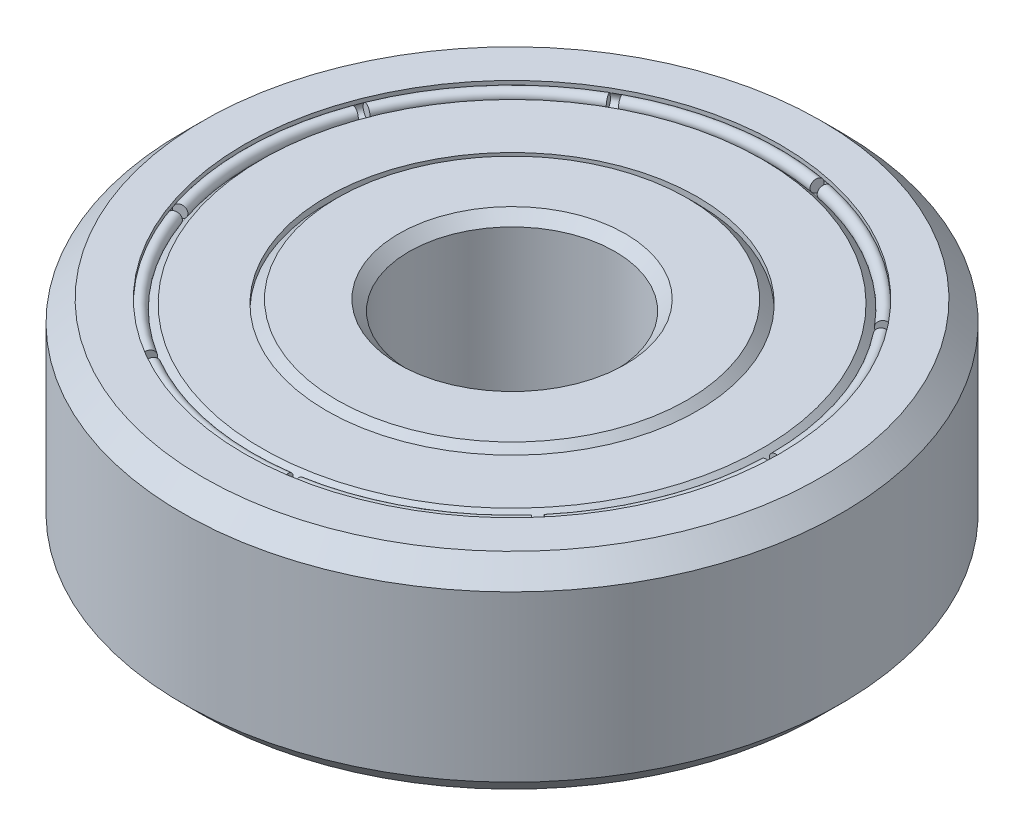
ISO-10303-21;
HEADER;
FILE_DESCRIPTION(('STEP AP214'),'2;1');
FILE_NAME('part.step','',(''),(''),'','','');
FILE_SCHEMA(('AUTOMOTIVE_DESIGN { 1 0 10303 214 1 1 1 1 }'));
ENDSEC;
DATA;
#1=APPLICATION_CONTEXT('core data for automotive mechanical design processes');
#2=APPLICATION_PROTOCOL_DEFINITION('international standard','automotive_design',2000,#1);
#3=PRODUCT_CONTEXT('',#1,'mechanical');
#4=PRODUCT('Part','Part','',(#3));
#5=PRODUCT_RELATED_PRODUCT_CATEGORY('part','',(#4));
#6=PRODUCT_DEFINITION_FORMATION('','',#4);
#7=PRODUCT_DEFINITION_CONTEXT('part definition',#1,'design');
#8=PRODUCT_DEFINITION('design','',#6,#7);
#9=PRODUCT_DEFINITION_SHAPE('','',#8);
#10=(LENGTH_UNIT() NAMED_UNIT(*) SI_UNIT(.MILLI.,.METRE.));
#11=(NAMED_UNIT(*) PLANE_ANGLE_UNIT() SI_UNIT($,.RADIAN.));
#12=(NAMED_UNIT(*) SI_UNIT($,.STERADIAN.) SOLID_ANGLE_UNIT());
#13=UNCERTAINTY_MEASURE_WITH_UNIT(LENGTH_MEASURE(1.E-05),#10,'distance_accuracy_value','');
#14=(GEOMETRIC_REPRESENTATION_CONTEXT(3) GLOBAL_UNCERTAINTY_ASSIGNED_CONTEXT((#13)) GLOBAL_UNIT_ASSIGNED_CONTEXT((#10,
#11,#12)) REPRESENTATION_CONTEXT('',''));
#15=CARTESIAN_POINT('',(0.,0.,0.));
#16=DIRECTION('',(0.,0.,1.));
#17=DIRECTION('',(1.,0.,0.));
#18=AXIS2_PLACEMENT_3D('',#15,#16,#17);
#19=CARTESIAN_POINT('',(0.,2.29393398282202,0.));
#20=DIRECTION('',(0.,1.,0.));
#21=DIRECTION('',(-0.642787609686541,0.,-0.766044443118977));
#22=AXIS2_PLACEMENT_3D('',#19,#20,#21);
#23=TOROIDAL_SURFACE('',#22,6.39393398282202,0.150000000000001);
#24=CARTESIAN_POINT('',(4.8980375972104,2.29393398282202,-4.10994154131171));
#25=DIRECTION('',(-0.642787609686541,0.,-0.766044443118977));
#26=DIRECTION('',(0.766044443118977,0.,-0.642787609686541));
#27=AXIS2_PLACEMENT_3D('',#24,#25,#26);
#28=CIRCLE('',#27,0.150000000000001);
#29=CARTESIAN_POINT('',(5.01294426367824,2.29393398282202,-4.20635968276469));
#30=VERTEX_POINT('',#29);
#31=EDGE_CURVE('E49',#30,#30,#28,.T.);
#32=CARTESIAN_POINT('',(1.32937362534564,2.29393398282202,-6.25421118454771));
#33=DIRECTION('',(-0.978147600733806,0.,-0.207911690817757));
#34=DIRECTION('',(0.207911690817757,0.,-0.978147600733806));
#35=AXIS2_PLACEMENT_3D('',#32,#33,#34);
#36=CIRCLE('',#35,0.150000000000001);
#37=CARTESIAN_POINT('',(1.3605603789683,2.29393398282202,-6.40093332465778));
#38=VERTEX_POINT('',#37);
#39=EDGE_CURVE('E11',#38,#38,#36,.T.);
#40=CARTESIAN_POINT('',(0.,2.29393398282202,0.));
#41=DIRECTION('',(0.,1.,0.));
#42=DIRECTION('',(-0.642787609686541,0.,-0.766044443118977));
#43=AXIS2_PLACEMENT_3D('',#40,#41,#42);
#44=CIRCLE('',#43,6.54393398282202);
#45=EDGE_CURVE('',#30,#38,#44,.T.);
#46=ORIENTED_EDGE('',*,*,#31,.T.);
#47=ORIENTED_EDGE('',*,*,#39,.F.);
#48=ORIENTED_EDGE('',*,*,#45,.T.);
#49=ORIENTED_EDGE('',*,*,#45,.F.);
#50=EDGE_LOOP('',(#46,#48,#47,#49));
#51=FACE_BOUND('',#50,.T.);
#52=ADVANCED_FACE('F43',(#51),#23,.T.);
#53=CARTESIAN_POINT('',(1.32937362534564,2.29393398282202,-6.25421118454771));
#54=DIRECTION('',(0.978147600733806,0.,0.207911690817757));
#55=DIRECTION('',(0.207911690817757,0.,-0.978147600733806));
#56=AXIS2_PLACEMENT_3D('',#53,#54,#55);
#57=PLANE('',#56);
#58=ORIENTED_EDGE('',*,*,#39,.T.);
#59=EDGE_LOOP('',(#58));
#60=FACE_BOUND('',#59,.T.);
#61=ADVANCED_FACE('F58',(#60),#57,.F.);
#62=CARTESIAN_POINT('',(4.8980375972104,2.29393398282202,-4.10994154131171));
#63=DIRECTION('',(0.642787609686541,0.,0.766044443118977));
#64=DIRECTION('',(0.766044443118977,0.,-0.642787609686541));
#65=AXIS2_PLACEMENT_3D('',#62,#63,#64);
#66=PLANE('',#65);
#67=ORIENTED_EDGE('',*,*,#31,.F.);
#68=EDGE_LOOP('',(#67));
#69=FACE_BOUND('',#68,.T.);
#70=ADVANCED_FACE('F56',(#69),#66,.T.);
#71=CLOSED_SHELL('',(#52,#61,#70));
#72=MANIFOLD_SOLID_BREP('B2',#71);
#73=CARTESIAN_POINT('',(0.,2.29393398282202,0.));
#74=DIRECTION('',(0.,1.,0.));
#75=DIRECTION('',(-0.984807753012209,0.,-0.173648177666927));
#76=AXIS2_PLACEMENT_3D('',#73,#74,#75);
#77=TOROIDAL_SURFACE('',#76,6.39393398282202,0.150000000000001);
#78=CARTESIAN_POINT('',(1.11029498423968,2.29393398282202,-6.29679575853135));
#79=DIRECTION('',(-0.984807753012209,0.,-0.173648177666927));
#80=DIRECTION('',(0.173648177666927,0.,-0.984807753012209));
#81=AXIS2_PLACEMENT_3D('',#78,#79,#80);
#82=CIRCLE('',#81,0.150000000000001);
#83=CARTESIAN_POINT('',(1.13634221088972,2.29393398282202,-6.44451692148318));
#84=VERTEX_POINT('',#83);
#85=EDGE_CURVE('E115',#84,#84,#82,.T.);
#86=CARTESIAN_POINT('',(-3.00177017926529,2.29393398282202,-5.64550861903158));
#87=DIRECTION('',(-0.882947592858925,0.,0.469471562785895));
#88=DIRECTION('',(-0.469471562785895,0.,-0.882947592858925));
#89=AXIS2_PLACEMENT_3D('',#86,#87,#88);
#90=CIRCLE('',#89,0.150000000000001);
#91=CARTESIAN_POINT('',(-3.07219091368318,2.29393398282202,-5.77795075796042));
#92=VERTEX_POINT('',#91);
#93=EDGE_CURVE('E42',#92,#92,#90,.T.);
#94=CARTESIAN_POINT('',(0.,2.29393398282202,0.));
#95=DIRECTION('',(0.,1.,0.));
#96=DIRECTION('',(-0.984807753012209,0.,-0.173648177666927));
#97=AXIS2_PLACEMENT_3D('',#94,#95,#96);
#98=CIRCLE('',#97,6.54393398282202);
#99=EDGE_CURVE('',#84,#92,#98,.T.);
#100=ORIENTED_EDGE('',*,*,#85,.T.);
#101=ORIENTED_EDGE('',*,*,#93,.F.);
#102=ORIENTED_EDGE('',*,*,#99,.T.);
#103=ORIENTED_EDGE('',*,*,#99,.F.);
#104=EDGE_LOOP('',(#100,#102,#101,#103));
#105=FACE_BOUND('',#104,.T.);
#106=ADVANCED_FACE('F109',(#105),#77,.T.);
#107=CARTESIAN_POINT('',(-3.00177017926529,2.29393398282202,-5.64550861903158));
#108=DIRECTION('',(0.882947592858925,0.,-0.469471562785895));
#109=DIRECTION('',(-0.469471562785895,0.,-0.882947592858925));
#110=AXIS2_PLACEMENT_3D('',#107,#108,#109);
#111=PLANE('',#110);
#112=ORIENTED_EDGE('',*,*,#93,.T.);
#113=EDGE_LOOP('',(#112));
#114=FACE_BOUND('',#113,.T.);
#115=ADVANCED_FACE('F124',(#114),#111,.F.);
#116=CARTESIAN_POINT('',(1.11029498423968,2.29393398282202,-6.29679575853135));
#117=DIRECTION('',(0.984807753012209,0.,0.173648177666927));
#118=DIRECTION('',(0.173648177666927,0.,-0.984807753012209));
#119=AXIS2_PLACEMENT_3D('',#116,#117,#118);
#120=PLANE('',#119);
#121=ORIENTED_EDGE('',*,*,#85,.F.);
#122=EDGE_LOOP('',(#121));
#123=FACE_BOUND('',#122,.T.);
#124=ADVANCED_FACE('F122',(#123),#120,.T.);
#125=CLOSED_SHELL('',(#106,#115,#124));
#126=MANIFOLD_SOLID_BREP('B6',#125);
#127=CARTESIAN_POINT('',(0.,2.29393398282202,0.));
#128=DIRECTION('',(0.,1.,0.));
#129=DIRECTION('',(-0.866025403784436,0.,0.500000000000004));
#130=AXIS2_PLACEMENT_3D('',#127,#128,#129);
#131=TOROIDAL_SURFACE('',#130,6.39393398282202,0.150000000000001);
#132=CARTESIAN_POINT('',(-3.19696699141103,2.29393398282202,-5.53730925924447));
#133=DIRECTION('',(-0.866025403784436,0.,0.500000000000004));
#134=DIRECTION('',(-0.500000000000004,0.,-0.866025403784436));
#135=AXIS2_PLACEMENT_3D('',#132,#133,#134);
#136=CIRCLE('',#135,0.150000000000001);
#137=CARTESIAN_POINT('',(-3.27196699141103,2.29393398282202,-5.66721306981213));
#138=VERTEX_POINT('',#137);
#139=EDGE_CURVE('E181',#138,#138,#136,.T.);
#140=CARTESIAN_POINT('',(-5.9283523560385,2.29393398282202,-2.39520982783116));
#141=DIRECTION('',(-0.374606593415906,0.,0.92718385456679));
#142=DIRECTION('',(-0.92718385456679,0.,-0.374606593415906));
#143=AXIS2_PLACEMENT_3D('',#140,#141,#142);
#144=CIRCLE('',#143,0.150000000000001);
#145=CARTESIAN_POINT('',(-6.06742993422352,2.29393398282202,-2.45140081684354));
#146=VERTEX_POINT('',#145);
#147=EDGE_CURVE('E108',#146,#146,#144,.T.);
#148=CARTESIAN_POINT('',(0.,2.29393398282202,0.));
#149=DIRECTION('',(0.,1.,0.));
#150=DIRECTION('',(-0.866025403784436,0.,0.500000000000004));
#151=AXIS2_PLACEMENT_3D('',#148,#149,#150);
#152=CIRCLE('',#151,6.54393398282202);
#153=EDGE_CURVE('',#138,#146,#152,.T.);
#154=ORIENTED_EDGE('',*,*,#139,.T.);
#155=ORIENTED_EDGE('',*,*,#147,.F.);
#156=ORIENTED_EDGE('',*,*,#153,.T.);
#157=ORIENTED_EDGE('',*,*,#153,.F.);
#158=EDGE_LOOP('',(#154,#156,#155,#157));
#159=FACE_BOUND('',#158,.T.);
#160=ADVANCED_FACE('F175',(#159),#131,.T.);
#161=CARTESIAN_POINT('',(-5.9283523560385,2.29393398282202,-2.39520982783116));
#162=DIRECTION('',(0.374606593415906,0.,-0.92718385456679));
#163=DIRECTION('',(-0.92718385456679,0.,-0.374606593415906));
#164=AXIS2_PLACEMENT_3D('',#161,#162,#163);
#165=PLANE('',#164);
#166=ORIENTED_EDGE('',*,*,#147,.T.);
#167=EDGE_LOOP('',(#166));
#168=FACE_BOUND('',#167,.T.);
#169=ADVANCED_FACE('F190',(#168),#165,.F.);
#170=CARTESIAN_POINT('',(-3.19696699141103,2.29393398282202,-5.53730925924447));
#171=DIRECTION('',(0.866025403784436,0.,-0.500000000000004));
#172=DIRECTION('',(-0.500000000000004,0.,-0.866025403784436));
#173=AXIS2_PLACEMENT_3D('',#170,#171,#172);
#174=PLANE('',#173);
#175=ORIENTED_EDGE('',*,*,#139,.F.);
#176=EDGE_LOOP('',(#175));
#177=FACE_BOUND('',#176,.T.);
#178=ADVANCED_FACE('F188',(#177),#174,.T.);
#179=CLOSED_SHELL('',(#160,#169,#178));
#180=MANIFOLD_SOLID_BREP('B37',#179);
#181=CARTESIAN_POINT('',(0.,2.29393398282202,0.));
#182=DIRECTION('',(0.,1.,0.));
#183=DIRECTION('',(-0.342020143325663,0.,0.939692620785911));
#184=AXIS2_PLACEMENT_3D('',#181,#182,#183);
#185=TOROIDAL_SURFACE('',#184,6.39393398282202,0.150000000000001);
#186=CARTESIAN_POINT('',(-6.00833258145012,2.29393398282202,-2.18685421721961));
#187=DIRECTION('',(-0.342020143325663,0.,0.939692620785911));
#188=DIRECTION('',(-0.939692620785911,0.,-0.342020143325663));
#189=AXIS2_PLACEMENT_3D('',#186,#187,#188);
#190=CIRCLE('',#189,0.150000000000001);
#191=CARTESIAN_POINT('',(-6.149286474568,2.29393398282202,-2.23815723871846));
#192=VERTEX_POINT('',#191);
#193=EDGE_CURVE('E247',#192,#192,#190,.T.);
#194=CARTESIAN_POINT('',(-6.08099257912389,2.29393398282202,1.97583426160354));
#195=DIRECTION('',(0.309016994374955,0.,0.951056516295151));
#196=DIRECTION('',(-0.951056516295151,0.,0.309016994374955));
#197=AXIS2_PLACEMENT_3D('',#194,#195,#196);
#198=CIRCLE('',#197,0.150000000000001);
#199=CARTESIAN_POINT('',(-6.22365105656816,2.29393398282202,2.02218681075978));
#200=VERTEX_POINT('',#199);
#201=EDGE_CURVE('E174',#200,#200,#198,.T.);
#202=CARTESIAN_POINT('',(0.,2.29393398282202,0.));
#203=DIRECTION('',(0.,1.,0.));
#204=DIRECTION('',(-0.342020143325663,0.,0.939692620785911));
#205=AXIS2_PLACEMENT_3D('',#202,#203,#204);
#206=CIRCLE('',#205,6.54393398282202);
#207=EDGE_CURVE('',#192,#200,#206,.T.);
#208=ORIENTED_EDGE('',*,*,#193,.T.);
#209=ORIENTED_EDGE('',*,*,#201,.F.);
#210=ORIENTED_EDGE('',*,*,#207,.T.);
#211=ORIENTED_EDGE('',*,*,#207,.F.);
#212=EDGE_LOOP('',(#208,#210,#209,#211));
#213=FACE_BOUND('',#212,.T.);
#214=ADVANCED_FACE('F241',(#213),#185,.T.);
#215=CARTESIAN_POINT('',(-6.08099257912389,2.29393398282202,1.97583426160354));
#216=DIRECTION('',(-0.309016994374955,0.,-0.951056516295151));
#217=DIRECTION('',(-0.951056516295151,0.,0.309016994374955));
#218=AXIS2_PLACEMENT_3D('',#215,#216,#217);
#219=PLANE('',#218);
#220=ORIENTED_EDGE('',*,*,#201,.T.);
#221=EDGE_LOOP('',(#220));
#222=FACE_BOUND('',#221,.T.);
#223=ADVANCED_FACE('F256',(#222),#219,.F.);
#224=CARTESIAN_POINT('',(-6.00833258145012,2.29393398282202,-2.18685421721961));
#225=DIRECTION('',(0.342020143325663,0.,-0.939692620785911));
#226=DIRECTION('',(-0.939692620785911,0.,-0.342020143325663));
#227=AXIS2_PLACEMENT_3D('',#224,#225,#226);
#228=PLANE('',#227);
#229=ORIENTED_EDGE('',*,*,#193,.F.);
#230=EDGE_LOOP('',(#229));
#231=FACE_BOUND('',#230,.T.);
#232=ADVANCED_FACE('F254',(#231),#228,.T.);
#233=CLOSED_SHELL('',(#214,#223,#232));
#234=MANIFOLD_SOLID_BREP('B103',#233);
#235=CARTESIAN_POINT('',(0.,2.29393398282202,0.));
#236=DIRECTION('',(0.,1.,0.));
#237=DIRECTION('',(0.342020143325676,0.,0.939692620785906));
#238=AXIS2_PLACEMENT_3D('',#235,#236,#237);
#239=TOROIDAL_SURFACE('',#238,6.39393398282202,0.150000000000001);
#240=CARTESIAN_POINT('',(-6.00833258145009,2.29393398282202,2.18685421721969));
#241=DIRECTION('',(0.342020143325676,0.,0.939692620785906));
#242=DIRECTION('',(-0.939692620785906,0.,0.342020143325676));
#243=AXIS2_PLACEMENT_3D('',#240,#241,#242);
#244=CIRCLE('',#243,0.150000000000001);
#245=CARTESIAN_POINT('',(-6.14928647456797,2.29393398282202,2.23815723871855));
#246=VERTEX_POINT('',#245);
#247=EDGE_CURVE('E313',#246,#246,#244,.T.);
#248=CARTESIAN_POINT('',(-3.38826879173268,2.29393398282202,5.42236354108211));
#249=DIRECTION('',(0.848048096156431,0.,0.529919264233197));
#250=DIRECTION('',(-0.529919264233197,0.,0.848048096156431));
#251=AXIS2_PLACEMENT_3D('',#248,#249,#250);
#252=CIRCLE('',#251,0.150000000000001);
#253=CARTESIAN_POINT('',(-3.46775668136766,2.29393398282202,5.54957075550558));
#254=VERTEX_POINT('',#253);
#255=EDGE_CURVE('E240',#254,#254,#252,.T.);
#256=CARTESIAN_POINT('',(0.,2.29393398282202,0.));
#257=DIRECTION('',(0.,1.,0.));
#258=DIRECTION('',(0.342020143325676,0.,0.939692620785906));
#259=AXIS2_PLACEMENT_3D('',#256,#257,#258);
#260=CIRCLE('',#259,6.54393398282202);
#261=EDGE_CURVE('',#246,#254,#260,.T.);
#262=ORIENTED_EDGE('',*,*,#247,.T.);
#263=ORIENTED_EDGE('',*,*,#255,.F.);
#264=ORIENTED_EDGE('',*,*,#261,.T.);
#265=ORIENTED_EDGE('',*,*,#261,.F.);
#266=EDGE_LOOP('',(#262,#264,#263,#265));
#267=FACE_BOUND('',#266,.T.);
#268=ADVANCED_FACE('F307',(#267),#239,.T.);
#269=CARTESIAN_POINT('',(-3.38826879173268,2.29393398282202,5.42236354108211));
#270=DIRECTION('',(-0.848048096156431,0.,-0.529919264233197));
#271=DIRECTION('',(-0.529919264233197,0.,0.848048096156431));
#272=AXIS2_PLACEMENT_3D('',#269,#270,#271);
#273=PLANE('',#272);
#274=ORIENTED_EDGE('',*,*,#255,.T.);
#275=EDGE_LOOP('',(#274));
#276=FACE_BOUND('',#275,.T.);
#277=ADVANCED_FACE('F322',(#276),#273,.F.);
#278=CARTESIAN_POINT('',(-6.00833258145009,2.29393398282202,2.18685421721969));
#279=DIRECTION('',(-0.342020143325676,0.,-0.939692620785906));
#280=DIRECTION('',(-0.939692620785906,0.,0.342020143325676));
#281=AXIS2_PLACEMENT_3D('',#278,#279,#280);
#282=PLANE('',#281);
#283=ORIENTED_EDGE('',*,*,#247,.F.);
#284=EDGE_LOOP('',(#283));
#285=FACE_BOUND('',#284,.T.);
#286=ADVANCED_FACE('F320',(#285),#282,.T.);
#287=CLOSED_SHELL('',(#268,#277,#286));
#288=MANIFOLD_SOLID_BREP('B169',#287);
#289=CARTESIAN_POINT('',(0.,2.29393398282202,0.));
#290=DIRECTION('',(0.,1.,0.));
#291=DIRECTION('',(0.866025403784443,0.,0.499999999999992));
#292=AXIS2_PLACEMENT_3D('',#289,#290,#291);
#293=TOROIDAL_SURFACE('',#292,6.39393398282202,0.150000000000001);
#294=CARTESIAN_POINT('',(-3.19696699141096,2.29393398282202,5.53730925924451));
#295=DIRECTION('',(0.866025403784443,0.,0.499999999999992));
#296=DIRECTION('',(-0.499999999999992,0.,0.866025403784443));
#297=AXIS2_PLACEMENT_3D('',#294,#295,#296);
#298=CIRCLE('',#297,0.150000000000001);
#299=CARTESIAN_POINT('',(-3.27196699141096,2.29393398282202,5.66721306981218));
#300=VERTEX_POINT('',#299);
#301=EDGE_CURVE('E379',#300,#300,#298,.T.);
#302=CARTESIAN_POINT('',(0.88986361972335,2.29393398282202,6.33170865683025));
#303=DIRECTION('',(0.990268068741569,0.,-0.139173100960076));
#304=DIRECTION('',(0.139173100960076,0.,0.990268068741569));
#305=AXIS2_PLACEMENT_3D('',#302,#303,#304);
#306=CIRCLE('',#305,0.150000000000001);
#307=CARTESIAN_POINT('',(0.910739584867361,2.29393398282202,6.48024886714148));
#308=VERTEX_POINT('',#307);
#309=EDGE_CURVE('E306',#308,#308,#306,.T.);
#310=CARTESIAN_POINT('',(0.,2.29393398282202,0.));
#311=DIRECTION('',(0.,1.,0.));
#312=DIRECTION('',(0.866025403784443,0.,0.499999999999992));
#313=AXIS2_PLACEMENT_3D('',#310,#311,#312);
#314=CIRCLE('',#313,6.54393398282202);
#315=EDGE_CURVE('',#300,#308,#314,.T.);
#316=ORIENTED_EDGE('',*,*,#301,.T.);
#317=ORIENTED_EDGE('',*,*,#309,.F.);
#318=ORIENTED_EDGE('',*,*,#315,.T.);
#319=ORIENTED_EDGE('',*,*,#315,.F.);
#320=EDGE_LOOP('',(#316,#318,#317,#319));
#321=FACE_BOUND('',#320,.T.);
#322=ADVANCED_FACE('F373',(#321),#293,.T.);
#323=CARTESIAN_POINT('',(0.88986361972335,2.29393398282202,6.33170865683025));
#324=DIRECTION('',(-0.990268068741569,0.,0.139173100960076));
#325=DIRECTION('',(0.139173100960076,0.,0.990268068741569));
#326=AXIS2_PLACEMENT_3D('',#323,#324,#325);
#327=PLANE('',#326);
#328=ORIENTED_EDGE('',*,*,#309,.T.);
#329=EDGE_LOOP('',(#328));
#330=FACE_BOUND('',#329,.T.);
#331=ADVANCED_FACE('F388',(#330),#327,.F.);
#332=CARTESIAN_POINT('',(-3.19696699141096,2.29393398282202,5.53730925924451));
#333=DIRECTION('',(-0.866025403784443,0.,-0.499999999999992));
#334=DIRECTION('',(-0.499999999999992,0.,0.866025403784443));
#335=AXIS2_PLACEMENT_3D('',#332,#333,#334);
#336=PLANE('',#335);
#337=ORIENTED_EDGE('',*,*,#301,.F.);
#338=EDGE_LOOP('',(#337));
#339=FACE_BOUND('',#338,.T.);
#340=ADVANCED_FACE('F386',(#339),#336,.T.);
#341=CLOSED_SHELL('',(#322,#331,#340));
#342=MANIFOLD_SOLID_BREP('B235',#341);
#343=CARTESIAN_POINT('',(0.,2.29393398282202,0.));
#344=DIRECTION('',(0.,1.,0.));
#345=DIRECTION('',(0.984807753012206,0.,-0.17364817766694));
#346=AXIS2_PLACEMENT_3D('',#343,#344,#345);
#347=TOROIDAL_SURFACE('',#346,6.39393398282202,0.150000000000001);
#348=CARTESIAN_POINT('',(1.11029498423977,2.29393398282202,6.29679575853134));
#349=DIRECTION('',(0.984807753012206,0.,-0.17364817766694));
#350=DIRECTION('',(0.17364817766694,0.,0.984807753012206));
#351=AXIS2_PLACEMENT_3D('',#348,#349,#350);
#352=CIRCLE('',#351,0.150000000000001);
#353=CARTESIAN_POINT('',(1.13634221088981,2.29393398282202,6.44451692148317));
#354=VERTEX_POINT('',#353);
#355=EDGE_CURVE('E445',#354,#354,#352,.T.);
#356=CARTESIAN_POINT('',(4.7516189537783,2.29393398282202,4.27837692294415));
#357=DIRECTION('',(0.669130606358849,0.,-0.743144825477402));
#358=DIRECTION('',(0.743144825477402,0.,0.669130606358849));
#359=AXIS2_PLACEMENT_3D('',#356,#357,#358);
#360=CIRCLE('',#359,0.150000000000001);
#361=CARTESIAN_POINT('',(4.86309067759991,2.29393398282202,4.37874651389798));
#362=VERTEX_POINT('',#361);
#363=EDGE_CURVE('E372',#362,#362,#360,.T.);
#364=CARTESIAN_POINT('',(0.,2.29393398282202,0.));
#365=DIRECTION('',(0.,1.,0.));
#366=DIRECTION('',(0.984807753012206,0.,-0.17364817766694));
#367=AXIS2_PLACEMENT_3D('',#364,#365,#366);
#368=CIRCLE('',#367,6.54393398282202);
#369=EDGE_CURVE('',#354,#362,#368,.T.);
#370=ORIENTED_EDGE('',*,*,#355,.T.);
#371=ORIENTED_EDGE('',*,*,#363,.F.);
#372=ORIENTED_EDGE('',*,*,#369,.T.);
#373=ORIENTED_EDGE('',*,*,#369,.F.);
#374=EDGE_LOOP('',(#370,#372,#371,#373));
#375=FACE_BOUND('',#374,.T.);
#376=ADVANCED_FACE('F439',(#375),#347,.T.);
#377=CARTESIAN_POINT('',(4.7516189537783,2.29393398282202,4.27837692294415));
#378=DIRECTION('',(-0.669130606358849,0.,0.743144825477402));
#379=DIRECTION('',(0.743144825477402,0.,0.669130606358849));
#380=AXIS2_PLACEMENT_3D('',#377,#378,#379);
#381=PLANE('',#380);
#382=ORIENTED_EDGE('',*,*,#363,.T.);
#383=EDGE_LOOP('',(#382));
#384=FACE_BOUND('',#383,.T.);
#385=ADVANCED_FACE('F454',(#384),#381,.F.);
#386=CARTESIAN_POINT('',(1.11029498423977,2.29393398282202,6.29679575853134));
#387=DIRECTION('',(-0.984807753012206,0.,0.17364817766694));
#388=DIRECTION('',(0.17364817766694,0.,0.984807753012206));
#389=AXIS2_PLACEMENT_3D('',#386,#387,#388);
#390=PLANE('',#389);
#391=ORIENTED_EDGE('',*,*,#355,.F.);
#392=EDGE_LOOP('',(#391));
#393=FACE_BOUND('',#392,.T.);
#394=ADVANCED_FACE('F452',(#393),#390,.T.);
#395=CLOSED_SHELL('',(#376,#385,#394));
#396=MANIFOLD_SOLID_BREP('B301',#395);
#397=CARTESIAN_POINT('',(0.,2.29393398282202,0.));
#398=DIRECTION('',(0.,1.,0.));
#399=DIRECTION('',(0.64278760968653,0.,-0.766044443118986));
#400=AXIS2_PLACEMENT_3D('',#397,#398,#399);
#401=TOROIDAL_SURFACE('',#400,6.39393398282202,0.150000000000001);
#402=CARTESIAN_POINT('',(4.89803759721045,2.29393398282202,4.10994154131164));
#403=DIRECTION('',(0.64278760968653,0.,-0.766044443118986));
#404=DIRECTION('',(0.766044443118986,0.,0.64278760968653));
#405=AXIS2_PLACEMENT_3D('',#402,#403,#404);
#406=CIRCLE('',#405,0.150000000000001);
#407=CARTESIAN_POINT('',(5.0129442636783,2.29393398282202,4.20635968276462));
#408=VERTEX_POINT('',#407);
#409=EDGE_CURVE('E511',#408,#408,#406,.T.);
#410=CARTESIAN_POINT('',(6.390038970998,2.29393398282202,0.223145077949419));
#411=DIRECTION('',(0.0348994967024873,0.,-0.999390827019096));
#412=DIRECTION('',(0.999390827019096,0.,0.0348994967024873));
#413=AXIS2_PLACEMENT_3D('',#410,#411,#412);
#414=CIRCLE('',#413,0.150000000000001);
#415=CARTESIAN_POINT('',(6.53994759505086,2.29393398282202,0.228380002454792));
#416=VERTEX_POINT('',#415);
#417=EDGE_CURVE('E438',#416,#416,#414,.T.);
#418=CARTESIAN_POINT('',(0.,2.29393398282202,0.));
#419=DIRECTION('',(0.,1.,0.));
#420=DIRECTION('',(0.64278760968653,0.,-0.766044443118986));
#421=AXIS2_PLACEMENT_3D('',#418,#419,#420);
#422=CIRCLE('',#421,6.54393398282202);
#423=EDGE_CURVE('',#408,#416,#422,.T.);
#424=ORIENTED_EDGE('',*,*,#409,.T.);
#425=ORIENTED_EDGE('',*,*,#417,.F.);
#426=ORIENTED_EDGE('',*,*,#423,.T.);
#427=ORIENTED_EDGE('',*,*,#423,.F.);
#428=EDGE_LOOP('',(#424,#426,#425,#427));
#429=FACE_BOUND('',#428,.T.);
#430=ADVANCED_FACE('F505',(#429),#401,.T.);
#431=CARTESIAN_POINT('',(6.390038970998,2.29393398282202,0.223145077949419));
#432=DIRECTION('',(-0.0348994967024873,0.,0.999390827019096));
#433=DIRECTION('',(0.999390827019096,0.,0.0348994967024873));
#434=AXIS2_PLACEMENT_3D('',#431,#432,#433);
#435=PLANE('',#434);
#436=ORIENTED_EDGE('',*,*,#417,.T.);
#437=EDGE_LOOP('',(#436));
#438=FACE_BOUND('',#437,.T.);
#439=ADVANCED_FACE('F520',(#438),#435,.F.);
#440=CARTESIAN_POINT('',(4.89803759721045,2.29393398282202,4.10994154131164));
#441=DIRECTION('',(-0.64278760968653,0.,0.766044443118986));
#442=DIRECTION('',(0.766044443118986,0.,0.64278760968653));
#443=AXIS2_PLACEMENT_3D('',#440,#441,#442);
#444=PLANE('',#443);
#445=ORIENTED_EDGE('',*,*,#409,.F.);
#446=EDGE_LOOP('',(#445));
#447=FACE_BOUND('',#446,.T.);
#448=ADVANCED_FACE('F518',(#447),#444,.T.);
#449=CLOSED_SHELL('',(#430,#439,#448));
#450=MANIFOLD_SOLID_BREP('B367',#449);
#451=CARTESIAN_POINT('',(0.,2.29393398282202,0.));
#452=DIRECTION('',(0.,1.,0.));
#453=DIRECTION('',(0.,0.,-1.));
#454=AXIS2_PLACEMENT_3D('',#451,#452,#453);
#455=TOROIDAL_SURFACE('',#454,6.39393398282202,0.150000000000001);
#456=CARTESIAN_POINT('',(6.39393398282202,2.29393398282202,0.));
#457=DIRECTION('',(0.,0.,-1.));
#458=DIRECTION('',(1.,0.,0.));
#459=AXIS2_PLACEMENT_3D('',#456,#457,#458);
#460=CIRCLE('',#459,0.150000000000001);
#461=CARTESIAN_POINT('',(6.54393398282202,2.29393398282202,0.));
#462=VERTEX_POINT('',#461);
#463=EDGE_CURVE('E577',#462,#462,#460,.T.);
#464=CARTESIAN_POINT('',(5.0384887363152,2.29393398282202,-3.93649882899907));
#465=DIRECTION('',(-0.615661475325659,0.,-0.788010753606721));
#466=DIRECTION('',(0.788010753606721,0.,-0.615661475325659));
#467=AXIS2_PLACEMENT_3D('',#464,#465,#466);
#468=CIRCLE('',#467,0.150000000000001);
#469=CARTESIAN_POINT('',(5.15669034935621,2.29393398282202,-4.02884805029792));
#470=VERTEX_POINT('',#469);
#471=EDGE_CURVE('E504',#470,#470,#468,.T.);
#472=CARTESIAN_POINT('',(0.,2.29393398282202,0.));
#473=DIRECTION('',(0.,1.,0.));
#474=DIRECTION('',(0.,0.,-1.));
#475=AXIS2_PLACEMENT_3D('',#472,#473,#474);
#476=CIRCLE('',#475,6.54393398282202);
#477=EDGE_CURVE('',#462,#470,#476,.T.);
#478=ORIENTED_EDGE('',*,*,#463,.T.);
#479=ORIENTED_EDGE('',*,*,#471,.F.);
#480=ORIENTED_EDGE('',*,*,#477,.T.);
#481=ORIENTED_EDGE('',*,*,#477,.F.);
#482=EDGE_LOOP('',(#478,#480,#479,#481));
#483=FACE_BOUND('',#482,.T.);
#484=ADVANCED_FACE('F571',(#483),#455,.T.);
#485=CARTESIAN_POINT('',(5.0384887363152,2.29393398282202,-3.93649882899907));
#486=DIRECTION('',(0.615661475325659,0.,0.788010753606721));
#487=DIRECTION('',(0.788010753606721,0.,-0.615661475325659));
#488=AXIS2_PLACEMENT_3D('',#485,#486,#487);
#489=PLANE('',#488);
#490=ORIENTED_EDGE('',*,*,#471,.T.);
#491=EDGE_LOOP('',(#490));
#492=FACE_BOUND('',#491,.T.);
#493=ADVANCED_FACE('F586',(#492),#489,.F.);
#494=CARTESIAN_POINT('',(6.39393398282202,2.29393398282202,0.));
#495=DIRECTION('',(0.,0.,1.));
#496=DIRECTION('',(1.,0.,0.));
#497=AXIS2_PLACEMENT_3D('',#494,#495,#496);
#498=PLANE('',#497);
#499=ORIENTED_EDGE('',*,*,#463,.F.);
#500=EDGE_LOOP('',(#499));
#501=FACE_BOUND('',#500,.T.);
#502=ADVANCED_FACE('F584',(#501),#498,.T.);
#503=CLOSED_SHELL('',(#484,#493,#502));
#504=MANIFOLD_SOLID_BREP('B433',#503);
#505=CARTESIAN_POINT('',(0.,-2.29393398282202,0.));
#506=DIRECTION('',(0.,-1.,0.));
#507=DIRECTION('',(0.64278760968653,0.,-0.766044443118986));
#508=AXIS2_PLACEMENT_3D('',#505,#506,#507);
#509=TOROIDAL_SURFACE('',#508,6.39393398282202,0.150000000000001);
#510=CARTESIAN_POINT('',(6.390038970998,-2.29393398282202,0.223145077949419));
#511=DIRECTION('',(-0.0348994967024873,0.,0.999390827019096));
#512=DIRECTION('',(0.999390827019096,0.,0.0348994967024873));
#513=AXIS2_PLACEMENT_3D('',#510,#511,#512);
#514=CIRCLE('',#513,0.150000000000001);
#515=CARTESIAN_POINT('',(6.53994759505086,-2.29393398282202,0.228380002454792));
#516=VERTEX_POINT('',#515);
#517=EDGE_CURVE('E570',#516,#516,#514,.T.);
#518=CARTESIAN_POINT('',(4.89803759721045,-2.29393398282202,4.10994154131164));
#519=DIRECTION('',(-0.64278760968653,0.,0.766044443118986));
#520=DIRECTION('',(0.766044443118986,0.,0.64278760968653));
#521=AXIS2_PLACEMENT_3D('',#518,#519,#520);
#522=CIRCLE('',#521,0.150000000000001);
#523=CARTESIAN_POINT('',(5.0129442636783,-2.29393398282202,4.20635968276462));
#524=VERTEX_POINT('',#523);
#525=EDGE_CURVE('E643',#524,#524,#522,.T.);
#526=CARTESIAN_POINT('',(0.,-2.29393398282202,0.));
#527=DIRECTION('',(0.,-1.,0.));
#528=DIRECTION('',(0.64278760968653,0.,-0.766044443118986));
#529=AXIS2_PLACEMENT_3D('',#526,#527,#528);
#530=CIRCLE('',#529,6.54393398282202);
#531=EDGE_CURVE('',#516,#524,#530,.T.);
#532=ORIENTED_EDGE('',*,*,#517,.T.);
#533=ORIENTED_EDGE('',*,*,#525,.F.);
#534=ORIENTED_EDGE('',*,*,#531,.T.);
#535=ORIENTED_EDGE('',*,*,#531,.F.);
#536=EDGE_LOOP('',(#532,#534,#533,#535));
#537=FACE_BOUND('',#536,.T.);
#538=ADVANCED_FACE('F637',(#537),#509,.T.);
#539=CARTESIAN_POINT('',(6.390038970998,-2.29393398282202,0.223145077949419));
#540=DIRECTION('',(-0.0348994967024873,0.,0.999390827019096));
#541=DIRECTION('',(0.999390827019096,0.,0.0348994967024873));
#542=AXIS2_PLACEMENT_3D('',#539,#540,#541);
#543=PLANE('',#542);
#544=ORIENTED_EDGE('',*,*,#517,.F.);
#545=EDGE_LOOP('',(#544));
#546=FACE_BOUND('',#545,.T.);
#547=ADVANCED_FACE('F652',(#546),#543,.F.);
#548=CARTESIAN_POINT('',(4.89803759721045,-2.29393398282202,4.10994154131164));
#549=DIRECTION('',(-0.64278760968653,0.,0.766044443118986));
#550=DIRECTION('',(0.766044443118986,0.,0.64278760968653));
#551=AXIS2_PLACEMENT_3D('',#548,#549,#550);
#552=PLANE('',#551);
#553=ORIENTED_EDGE('',*,*,#525,.T.);
#554=EDGE_LOOP('',(#553));
#555=FACE_BOUND('',#554,.T.);
#556=ADVANCED_FACE('F649',(#555),#552,.T.);
#557=CLOSED_SHELL('',(#538,#547,#556));
#558=MANIFOLD_SOLID_BREP('B499',#557);
#559=CARTESIAN_POINT('',(0.,-2.29393398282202,0.));
#560=DIRECTION('',(0.,-1.,0.));
#561=DIRECTION('',(0.984807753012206,0.,-0.17364817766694));
#562=AXIS2_PLACEMENT_3D('',#559,#560,#561);
#563=TOROIDAL_SURFACE('',#562,6.39393398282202,0.150000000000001);
#564=CARTESIAN_POINT('',(4.7516189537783,-2.29393398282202,4.27837692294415));
#565=DIRECTION('',(-0.669130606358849,0.,0.743144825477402));
#566=DIRECTION('',(0.743144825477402,0.,0.669130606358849));
#567=AXIS2_PLACEMENT_3D('',#564,#565,#566);
#568=CIRCLE('',#567,0.150000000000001);
#569=CARTESIAN_POINT('',(4.86309067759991,-2.29393398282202,4.37874651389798));
#570=VERTEX_POINT('',#569);
#571=EDGE_CURVE('E636',#570,#570,#568,.T.);
#572=CARTESIAN_POINT('',(1.11029498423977,-2.29393398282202,6.29679575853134));
#573=DIRECTION('',(-0.984807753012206,0.,0.17364817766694));
#574=DIRECTION('',(0.17364817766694,0.,0.984807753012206));
#575=AXIS2_PLACEMENT_3D('',#572,#573,#574);
#576=CIRCLE('',#575,0.150000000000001);
#577=CARTESIAN_POINT('',(1.13634221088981,-2.29393398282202,6.44451692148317));
#578=VERTEX_POINT('',#577);
#579=EDGE_CURVE('E709',#578,#578,#576,.T.);
#580=CARTESIAN_POINT('',(0.,-2.29393398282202,0.));
#581=DIRECTION('',(0.,-1.,0.));
#582=DIRECTION('',(0.984807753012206,0.,-0.17364817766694));
#583=AXIS2_PLACEMENT_3D('',#580,#581,#582);
#584=CIRCLE('',#583,6.54393398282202);
#585=EDGE_CURVE('',#570,#578,#584,.T.);
#586=ORIENTED_EDGE('',*,*,#571,.T.);
#587=ORIENTED_EDGE('',*,*,#579,.F.);
#588=ORIENTED_EDGE('',*,*,#585,.T.);
#589=ORIENTED_EDGE('',*,*,#585,.F.);
#590=EDGE_LOOP('',(#586,#588,#587,#589));
#591=FACE_BOUND('',#590,.T.);
#592=ADVANCED_FACE('F703',(#591),#563,.T.);
#593=CARTESIAN_POINT('',(4.7516189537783,-2.29393398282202,4.27837692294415));
#594=DIRECTION('',(-0.669130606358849,0.,0.743144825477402));
#595=DIRECTION('',(0.743144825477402,0.,0.669130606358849));
#596=AXIS2_PLACEMENT_3D('',#593,#594,#595);
#597=PLANE('',#596);
#598=ORIENTED_EDGE('',*,*,#571,.F.);
#599=EDGE_LOOP('',(#598));
#600=FACE_BOUND('',#599,.T.);
#601=ADVANCED_FACE('F718',(#600),#597,.F.);
#602=CARTESIAN_POINT('',(1.11029498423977,-2.29393398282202,6.29679575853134));
#603=DIRECTION('',(-0.984807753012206,0.,0.17364817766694));
#604=DIRECTION('',(0.17364817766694,0.,0.984807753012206));
#605=AXIS2_PLACEMENT_3D('',#602,#603,#604);
#606=PLANE('',#605);
#607=ORIENTED_EDGE('',*,*,#579,.T.);
#608=EDGE_LOOP('',(#607));
#609=FACE_BOUND('',#608,.T.);
#610=ADVANCED_FACE('F715',(#609),#606,.T.);
#611=CLOSED_SHELL('',(#592,#601,#610));
#612=MANIFOLD_SOLID_BREP('B565',#611);
#613=CARTESIAN_POINT('',(0.,-2.29393398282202,0.));
#614=DIRECTION('',(0.,-1.,0.));
#615=DIRECTION('',(0.866025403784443,0.,0.499999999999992));
#616=AXIS2_PLACEMENT_3D('',#613,#614,#615);
#617=TOROIDAL_SURFACE('',#616,6.39393398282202,0.150000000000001);
#618=CARTESIAN_POINT('',(0.88986361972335,-2.29393398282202,6.33170865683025));
#619=DIRECTION('',(-0.990268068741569,0.,0.139173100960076));
#620=DIRECTION('',(0.139173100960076,0.,0.990268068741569));
#621=AXIS2_PLACEMENT_3D('',#618,#619,#620);
#622=CIRCLE('',#621,0.150000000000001);
#623=CARTESIAN_POINT('',(0.910739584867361,-2.29393398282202,6.48024886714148));
#624=VERTEX_POINT('',#623);
#625=EDGE_CURVE('E702',#624,#624,#622,.T.);
#626=CARTESIAN_POINT('',(-3.19696699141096,-2.29393398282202,5.53730925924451));
#627=DIRECTION('',(-0.866025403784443,0.,-0.499999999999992));
#628=DIRECTION('',(-0.499999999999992,0.,0.866025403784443));
#629=AXIS2_PLACEMENT_3D('',#626,#627,#628);
#630=CIRCLE('',#629,0.150000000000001);
#631=CARTESIAN_POINT('',(-3.27196699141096,-2.29393398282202,5.66721306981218));
#632=VERTEX_POINT('',#631);
#633=EDGE_CURVE('E775',#632,#632,#630,.T.);
#634=CARTESIAN_POINT('',(0.,-2.29393398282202,0.));
#635=DIRECTION('',(0.,-1.,0.));
#636=DIRECTION('',(0.866025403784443,0.,0.499999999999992));
#637=AXIS2_PLACEMENT_3D('',#634,#635,#636);
#638=CIRCLE('',#637,6.54393398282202);
#639=EDGE_CURVE('',#624,#632,#638,.T.);
#640=ORIENTED_EDGE('',*,*,#625,.T.);
#641=ORIENTED_EDGE('',*,*,#633,.F.);
#642=ORIENTED_EDGE('',*,*,#639,.T.);
#643=ORIENTED_EDGE('',*,*,#639,.F.);
#644=EDGE_LOOP('',(#640,#642,#641,#643));
#645=FACE_BOUND('',#644,.T.);
#646=ADVANCED_FACE('F769',(#645),#617,.T.);
#647=CARTESIAN_POINT('',(0.88986361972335,-2.29393398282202,6.33170865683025));
#648=DIRECTION('',(-0.990268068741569,0.,0.139173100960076));
#649=DIRECTION('',(0.139173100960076,0.,0.990268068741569));
#650=AXIS2_PLACEMENT_3D('',#647,#648,#649);
#651=PLANE('',#650);
#652=ORIENTED_EDGE('',*,*,#625,.F.);
#653=EDGE_LOOP('',(#652));
#654=FACE_BOUND('',#653,.T.);
#655=ADVANCED_FACE('F784',(#654),#651,.F.);
#656=CARTESIAN_POINT('',(-3.19696699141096,-2.29393398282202,5.53730925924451));
#657=DIRECTION('',(-0.866025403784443,0.,-0.499999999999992));
#658=DIRECTION('',(-0.499999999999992,0.,0.866025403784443));
#659=AXIS2_PLACEMENT_3D('',#656,#657,#658);
#660=PLANE('',#659);
#661=ORIENTED_EDGE('',*,*,#633,.T.);
#662=EDGE_LOOP('',(#661));
#663=FACE_BOUND('',#662,.T.);
#664=ADVANCED_FACE('F781',(#663),#660,.T.);
#665=CLOSED_SHELL('',(#646,#655,#664));
#666=MANIFOLD_SOLID_BREP('B631',#665);
#667=CARTESIAN_POINT('',(0.,-2.29393398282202,0.));
#668=DIRECTION('',(0.,-1.,0.));
#669=DIRECTION('',(0.342020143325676,0.,0.939692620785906));
#670=AXIS2_PLACEMENT_3D('',#667,#668,#669);
#671=TOROIDAL_SURFACE('',#670,6.39393398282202,0.150000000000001);
#672=CARTESIAN_POINT('',(-3.38826879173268,-2.29393398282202,5.42236354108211));
#673=DIRECTION('',(-0.848048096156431,0.,-0.529919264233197));
#674=DIRECTION('',(-0.529919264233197,0.,0.848048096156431));
#675=AXIS2_PLACEMENT_3D('',#672,#673,#674);
#676=CIRCLE('',#675,0.150000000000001);
#677=CARTESIAN_POINT('',(-3.46775668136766,-2.29393398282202,5.54957075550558));
#678=VERTEX_POINT('',#677);
#679=EDGE_CURVE('E768',#678,#678,#676,.T.);
#680=CARTESIAN_POINT('',(-6.00833258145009,-2.29393398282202,2.18685421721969));
#681=DIRECTION('',(-0.342020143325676,0.,-0.939692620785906));
#682=DIRECTION('',(-0.939692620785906,0.,0.342020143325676));
#683=AXIS2_PLACEMENT_3D('',#680,#681,#682);
#684=CIRCLE('',#683,0.150000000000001);
#685=CARTESIAN_POINT('',(-6.14928647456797,-2.29393398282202,2.23815723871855));
#686=VERTEX_POINT('',#685);
#687=EDGE_CURVE('E841',#686,#686,#684,.T.);
#688=CARTESIAN_POINT('',(0.,-2.29393398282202,0.));
#689=DIRECTION('',(0.,-1.,0.));
#690=DIRECTION('',(0.342020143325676,0.,0.939692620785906));
#691=AXIS2_PLACEMENT_3D('',#688,#689,#690);
#692=CIRCLE('',#691,6.54393398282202);
#693=EDGE_CURVE('',#678,#686,#692,.T.);
#694=ORIENTED_EDGE('',*,*,#679,.T.);
#695=ORIENTED_EDGE('',*,*,#687,.F.);
#696=ORIENTED_EDGE('',*,*,#693,.T.);
#697=ORIENTED_EDGE('',*,*,#693,.F.);
#698=EDGE_LOOP('',(#694,#696,#695,#697));
#699=FACE_BOUND('',#698,.T.);
#700=ADVANCED_FACE('F835',(#699),#671,.T.);
#701=CARTESIAN_POINT('',(-3.38826879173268,-2.29393398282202,5.42236354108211));
#702=DIRECTION('',(-0.848048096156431,0.,-0.529919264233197));
#703=DIRECTION('',(-0.529919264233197,0.,0.848048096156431));
#704=AXIS2_PLACEMENT_3D('',#701,#702,#703);
#705=PLANE('',#704);
#706=ORIENTED_EDGE('',*,*,#679,.F.);
#707=EDGE_LOOP('',(#706));
#708=FACE_BOUND('',#707,.T.);
#709=ADVANCED_FACE('F850',(#708),#705,.F.);
#710=CARTESIAN_POINT('',(-6.00833258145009,-2.29393398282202,2.18685421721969));
#711=DIRECTION('',(-0.342020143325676,0.,-0.939692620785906));
#712=DIRECTION('',(-0.939692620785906,0.,0.342020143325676));
#713=AXIS2_PLACEMENT_3D('',#710,#711,#712);
#714=PLANE('',#713);
#715=ORIENTED_EDGE('',*,*,#687,.T.);
#716=EDGE_LOOP('',(#715));
#717=FACE_BOUND('',#716,.T.);
#718=ADVANCED_FACE('F847',(#717),#714,.T.);
#719=CLOSED_SHELL('',(#700,#709,#718));
#720=MANIFOLD_SOLID_BREP('B697',#719);
#721=CARTESIAN_POINT('',(0.,-2.29393398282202,0.));
#722=DIRECTION('',(0.,-1.,0.));
#723=DIRECTION('',(-0.342020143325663,0.,0.939692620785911));
#724=AXIS2_PLACEMENT_3D('',#721,#722,#723);
#725=TOROIDAL_SURFACE('',#724,6.39393398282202,0.150000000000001);
#726=CARTESIAN_POINT('',(-6.08099257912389,-2.29393398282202,1.97583426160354));
#727=DIRECTION('',(-0.309016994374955,0.,-0.951056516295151));
#728=DIRECTION('',(-0.951056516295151,0.,0.309016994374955));
#729=AXIS2_PLACEMENT_3D('',#726,#727,#728);
#730=CIRCLE('',#729,0.150000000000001);
#731=CARTESIAN_POINT('',(-6.22365105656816,-2.29393398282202,2.02218681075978));
#732=VERTEX_POINT('',#731);
#733=EDGE_CURVE('E834',#732,#732,#730,.T.);
#734=CARTESIAN_POINT('',(-6.00833258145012,-2.29393398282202,-2.18685421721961));
#735=DIRECTION('',(0.342020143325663,0.,-0.939692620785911));
#736=DIRECTION('',(-0.939692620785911,0.,-0.342020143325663));
#737=AXIS2_PLACEMENT_3D('',#734,#735,#736);
#738=CIRCLE('',#737,0.150000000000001);
#739=CARTESIAN_POINT('',(-6.149286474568,-2.29393398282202,-2.23815723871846));
#740=VERTEX_POINT('',#739);
#741=EDGE_CURVE('E907',#740,#740,#738,.T.);
#742=CARTESIAN_POINT('',(0.,-2.29393398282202,0.));
#743=DIRECTION('',(0.,-1.,0.));
#744=DIRECTION('',(-0.342020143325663,0.,0.939692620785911));
#745=AXIS2_PLACEMENT_3D('',#742,#743,#744);
#746=CIRCLE('',#745,6.54393398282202);
#747=EDGE_CURVE('',#732,#740,#746,.T.);
#748=ORIENTED_EDGE('',*,*,#733,.T.);
#749=ORIENTED_EDGE('',*,*,#741,.F.);
#750=ORIENTED_EDGE('',*,*,#747,.T.);
#751=ORIENTED_EDGE('',*,*,#747,.F.);
#752=EDGE_LOOP('',(#748,#750,#749,#751));
#753=FACE_BOUND('',#752,.T.);
#754=ADVANCED_FACE('F901',(#753),#725,.T.);
#755=CARTESIAN_POINT('',(-6.08099257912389,-2.29393398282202,1.97583426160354));
#756=DIRECTION('',(-0.309016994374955,0.,-0.951056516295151));
#757=DIRECTION('',(-0.951056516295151,0.,0.309016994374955));
#758=AXIS2_PLACEMENT_3D('',#755,#756,#757);
#759=PLANE('',#758);
#760=ORIENTED_EDGE('',*,*,#733,.F.);
#761=EDGE_LOOP('',(#760));
#762=FACE_BOUND('',#761,.T.);
#763=ADVANCED_FACE('F916',(#762),#759,.F.);
#764=CARTESIAN_POINT('',(-6.00833258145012,-2.29393398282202,-2.18685421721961));
#765=DIRECTION('',(0.342020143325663,0.,-0.939692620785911));
#766=DIRECTION('',(-0.939692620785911,0.,-0.342020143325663));
#767=AXIS2_PLACEMENT_3D('',#764,#765,#766);
#768=PLANE('',#767);
#769=ORIENTED_EDGE('',*,*,#741,.T.);
#770=EDGE_LOOP('',(#769));
#771=FACE_BOUND('',#770,.T.);
#772=ADVANCED_FACE('F913',(#771),#768,.T.);
#773=CLOSED_SHELL('',(#754,#763,#772));
#774=MANIFOLD_SOLID_BREP('B763',#773);
#775=CARTESIAN_POINT('',(0.,-2.29393398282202,0.));
#776=DIRECTION('',(0.,-1.,0.));
#777=DIRECTION('',(-0.866025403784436,0.,0.500000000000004));
#778=AXIS2_PLACEMENT_3D('',#775,#776,#777);
#779=TOROIDAL_SURFACE('',#778,6.39393398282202,0.150000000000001);
#780=CARTESIAN_POINT('',(-5.9283523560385,-2.29393398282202,-2.39520982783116));
#781=DIRECTION('',(0.374606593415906,0.,-0.92718385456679));
#782=DIRECTION('',(-0.92718385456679,0.,-0.374606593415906));
#783=AXIS2_PLACEMENT_3D('',#780,#781,#782);
#784=CIRCLE('',#783,0.150000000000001);
#785=CARTESIAN_POINT('',(-6.06742993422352,-2.29393398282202,-2.45140081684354));
#786=VERTEX_POINT('',#785);
#787=EDGE_CURVE('E900',#786,#786,#784,.T.);
#788=CARTESIAN_POINT('',(-3.19696699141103,-2.29393398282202,-5.53730925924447));
#789=DIRECTION('',(0.866025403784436,0.,-0.500000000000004));
#790=DIRECTION('',(-0.500000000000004,0.,-0.866025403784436));
#791=AXIS2_PLACEMENT_3D('',#788,#789,#790);
#792=CIRCLE('',#791,0.150000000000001);
#793=CARTESIAN_POINT('',(-3.27196699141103,-2.29393398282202,-5.66721306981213));
#794=VERTEX_POINT('',#793);
#795=EDGE_CURVE('E973',#794,#794,#792,.T.);
#796=CARTESIAN_POINT('',(0.,-2.29393398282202,0.));
#797=DIRECTION('',(0.,-1.,0.));
#798=DIRECTION('',(-0.866025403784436,0.,0.500000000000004));
#799=AXIS2_PLACEMENT_3D('',#796,#797,#798);
#800=CIRCLE('',#799,6.54393398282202);
#801=EDGE_CURVE('',#786,#794,#800,.T.);
#802=ORIENTED_EDGE('',*,*,#787,.T.);
#803=ORIENTED_EDGE('',*,*,#795,.F.);
#804=ORIENTED_EDGE('',*,*,#801,.T.);
#805=ORIENTED_EDGE('',*,*,#801,.F.);
#806=EDGE_LOOP('',(#802,#804,#803,#805));
#807=FACE_BOUND('',#806,.T.);
#808=ADVANCED_FACE('F967',(#807),#779,.T.);
#809=CARTESIAN_POINT('',(-5.9283523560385,-2.29393398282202,-2.39520982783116));
#810=DIRECTION('',(0.374606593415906,0.,-0.92718385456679));
#811=DIRECTION('',(-0.92718385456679,0.,-0.374606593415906));
#812=AXIS2_PLACEMENT_3D('',#809,#810,#811);
#813=PLANE('',#812);
#814=ORIENTED_EDGE('',*,*,#787,.F.);
#815=EDGE_LOOP('',(#814));
#816=FACE_BOUND('',#815,.T.);
#817=ADVANCED_FACE('F982',(#816),#813,.F.);
#818=CARTESIAN_POINT('',(-3.19696699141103,-2.29393398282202,-5.53730925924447));
#819=DIRECTION('',(0.866025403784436,0.,-0.500000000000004));
#820=DIRECTION('',(-0.500000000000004,0.,-0.866025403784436));
#821=AXIS2_PLACEMENT_3D('',#818,#819,#820);
#822=PLANE('',#821);
#823=ORIENTED_EDGE('',*,*,#795,.T.);
#824=EDGE_LOOP('',(#823));
#825=FACE_BOUND('',#824,.T.);
#826=ADVANCED_FACE('F979',(#825),#822,.T.);
#827=CLOSED_SHELL('',(#808,#817,#826));
#828=MANIFOLD_SOLID_BREP('B829',#827);
#829=CARTESIAN_POINT('',(0.,-2.29393398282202,0.));
#830=DIRECTION('',(0.,-1.,0.));
#831=DIRECTION('',(-0.984807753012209,0.,-0.173648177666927));
#832=AXIS2_PLACEMENT_3D('',#829,#830,#831);
#833=TOROIDAL_SURFACE('',#832,6.39393398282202,0.150000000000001);
#834=CARTESIAN_POINT('',(-3.00177017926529,-2.29393398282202,-5.64550861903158));
#835=DIRECTION('',(0.882947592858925,0.,-0.469471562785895));
#836=DIRECTION('',(-0.469471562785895,0.,-0.882947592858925));
#837=AXIS2_PLACEMENT_3D('',#834,#835,#836);
#838=CIRCLE('',#837,0.150000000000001);
#839=CARTESIAN_POINT('',(-3.07219091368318,-2.29393398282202,-5.77795075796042));
#840=VERTEX_POINT('',#839);
#841=EDGE_CURVE('E966',#840,#840,#838,.T.);
#842=CARTESIAN_POINT('',(1.11029498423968,-2.29393398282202,-6.29679575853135));
#843=DIRECTION('',(0.984807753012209,0.,0.173648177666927));
#844=DIRECTION('',(0.173648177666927,0.,-0.984807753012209));
#845=AXIS2_PLACEMENT_3D('',#842,#843,#844);
#846=CIRCLE('',#845,0.150000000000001);
#847=CARTESIAN_POINT('',(1.13634221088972,-2.29393398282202,-6.44451692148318));
#848=VERTEX_POINT('',#847);
#849=EDGE_CURVE('E1039',#848,#848,#846,.T.);
#850=CARTESIAN_POINT('',(0.,-2.29393398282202,0.));
#851=DIRECTION('',(0.,-1.,0.));
#852=DIRECTION('',(-0.984807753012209,0.,-0.173648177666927));
#853=AXIS2_PLACEMENT_3D('',#850,#851,#852);
#854=CIRCLE('',#853,6.54393398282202);
#855=EDGE_CURVE('',#840,#848,#854,.T.);
#856=ORIENTED_EDGE('',*,*,#841,.T.);
#857=ORIENTED_EDGE('',*,*,#849,.F.);
#858=ORIENTED_EDGE('',*,*,#855,.T.);
#859=ORIENTED_EDGE('',*,*,#855,.F.);
#860=EDGE_LOOP('',(#856,#858,#857,#859));
#861=FACE_BOUND('',#860,.T.);
#862=ADVANCED_FACE('F1033',(#861),#833,.T.);
#863=CARTESIAN_POINT('',(-3.00177017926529,-2.29393398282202,-5.64550861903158));
#864=DIRECTION('',(0.882947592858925,0.,-0.469471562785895));
#865=DIRECTION('',(-0.469471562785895,0.,-0.882947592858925));
#866=AXIS2_PLACEMENT_3D('',#863,#864,#865);
#867=PLANE('',#866);
#868=ORIENTED_EDGE('',*,*,#841,.F.);
#869=EDGE_LOOP('',(#868));
#870=FACE_BOUND('',#869,.T.);
#871=ADVANCED_FACE('F1048',(#870),#867,.F.);
#872=CARTESIAN_POINT('',(1.11029498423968,-2.29393398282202,-6.29679575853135));
#873=DIRECTION('',(0.984807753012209,0.,0.173648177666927));
#874=DIRECTION('',(0.173648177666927,0.,-0.984807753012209));
#875=AXIS2_PLACEMENT_3D('',#872,#873,#874);
#876=PLANE('',#875);
#877=ORIENTED_EDGE('',*,*,#849,.T.);
#878=EDGE_LOOP('',(#877));
#879=FACE_BOUND('',#878,.T.);
#880=ADVANCED_FACE('F1045',(#879),#876,.T.);
#881=CLOSED_SHELL('',(#862,#871,#880));
#882=MANIFOLD_SOLID_BREP('B895',#881);
#883=CARTESIAN_POINT('',(0.,-2.29393398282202,0.));
#884=DIRECTION('',(0.,-1.,0.));
#885=DIRECTION('',(-0.642787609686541,0.,-0.766044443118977));
#886=AXIS2_PLACEMENT_3D('',#883,#884,#885);
#887=TOROIDAL_SURFACE('',#886,6.39393398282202,0.150000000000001);
#888=CARTESIAN_POINT('',(1.32937362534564,-2.29393398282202,-6.25421118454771));
#889=DIRECTION('',(0.978147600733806,0.,0.207911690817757));
#890=DIRECTION('',(0.207911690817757,0.,-0.978147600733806));
#891=AXIS2_PLACEMENT_3D('',#888,#889,#890);
#892=CIRCLE('',#891,0.150000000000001);
#893=CARTESIAN_POINT('',(1.3605603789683,-2.29393398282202,-6.40093332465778));
#894=VERTEX_POINT('',#893);
#895=EDGE_CURVE('E1032',#894,#894,#892,.T.);
#896=CARTESIAN_POINT('',(4.8980375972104,-2.29393398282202,-4.10994154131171));
#897=DIRECTION('',(0.642787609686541,0.,0.766044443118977));
#898=DIRECTION('',(0.766044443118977,0.,-0.642787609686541));
#899=AXIS2_PLACEMENT_3D('',#896,#897,#898);
#900=CIRCLE('',#899,0.150000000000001);
#901=CARTESIAN_POINT('',(5.01294426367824,-2.29393398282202,-4.20635968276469));
#902=VERTEX_POINT('',#901);
#903=EDGE_CURVE('E1105',#902,#902,#900,.T.);
#904=CARTESIAN_POINT('',(0.,-2.29393398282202,0.));
#905=DIRECTION('',(0.,-1.,0.));
#906=DIRECTION('',(-0.642787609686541,0.,-0.766044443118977));
#907=AXIS2_PLACEMENT_3D('',#904,#905,#906);
#908=CIRCLE('',#907,6.54393398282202);
#909=EDGE_CURVE('',#894,#902,#908,.T.);
#910=ORIENTED_EDGE('',*,*,#895,.T.);
#911=ORIENTED_EDGE('',*,*,#903,.F.);
#912=ORIENTED_EDGE('',*,*,#909,.T.);
#913=ORIENTED_EDGE('',*,*,#909,.F.);
#914=EDGE_LOOP('',(#910,#912,#911,#913));
#915=FACE_BOUND('',#914,.T.);
#916=ADVANCED_FACE('F1099',(#915),#887,.T.);
#917=CARTESIAN_POINT('',(1.32937362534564,-2.29393398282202,-6.25421118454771));
#918=DIRECTION('',(0.978147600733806,0.,0.207911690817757));
#919=DIRECTION('',(0.207911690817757,0.,-0.978147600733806));
#920=AXIS2_PLACEMENT_3D('',#917,#918,#919);
#921=PLANE('',#920);
#922=ORIENTED_EDGE('',*,*,#895,.F.);
#923=EDGE_LOOP('',(#922));
#924=FACE_BOUND('',#923,.T.);
#925=ADVANCED_FACE('F1114',(#924),#921,.F.);
#926=CARTESIAN_POINT('',(4.8980375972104,-2.29393398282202,-4.10994154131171));
#927=DIRECTION('',(0.642787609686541,0.,0.766044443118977));
#928=DIRECTION('',(0.766044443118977,0.,-0.642787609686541));
#929=AXIS2_PLACEMENT_3D('',#926,#927,#928);
#930=PLANE('',#929);
#931=ORIENTED_EDGE('',*,*,#903,.T.);
#932=EDGE_LOOP('',(#931));
#933=FACE_BOUND('',#932,.T.);
#934=ADVANCED_FACE('F1111',(#933),#930,.T.);
#935=CLOSED_SHELL('',(#916,#925,#934));
#936=MANIFOLD_SOLID_BREP('B961',#935);
#937=CARTESIAN_POINT('',(0.,-2.29393398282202,0.));
#938=DIRECTION('',(0.,-1.,0.));
#939=DIRECTION('',(0.,0.,-1.));
#940=AXIS2_PLACEMENT_3D('',#937,#938,#939);
#941=TOROIDAL_SURFACE('',#940,6.39393398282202,0.150000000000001);
#942=CARTESIAN_POINT('',(5.0384887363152,-2.29393398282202,-3.93649882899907));
#943=DIRECTION('',(0.615661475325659,0.,0.788010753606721));
#944=DIRECTION('',(0.788010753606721,0.,-0.615661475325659));
#945=AXIS2_PLACEMENT_3D('',#942,#943,#944);
#946=CIRCLE('',#945,0.150000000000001);
#947=CARTESIAN_POINT('',(5.15669034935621,-2.29393398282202,-4.02884805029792));
#948=VERTEX_POINT('',#947);
#949=EDGE_CURVE('E1098',#948,#948,#946,.T.);
#950=CARTESIAN_POINT('',(6.39393398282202,-2.29393398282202,0.));
#951=DIRECTION('',(0.,0.,1.));
#952=DIRECTION('',(1.,0.,0.));
#953=AXIS2_PLACEMENT_3D('',#950,#951,#952);
#954=CIRCLE('',#953,0.150000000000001);
#955=CARTESIAN_POINT('',(6.54393398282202,-2.29393398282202,0.));
#956=VERTEX_POINT('',#955);
#957=EDGE_CURVE('E1170',#956,#956,#954,.T.);
#958=CARTESIAN_POINT('',(0.,-2.29393398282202,0.));
#959=DIRECTION('',(0.,-1.,0.));
#960=DIRECTION('',(0.,0.,-1.));
#961=AXIS2_PLACEMENT_3D('',#958,#959,#960);
#962=CIRCLE('',#961,6.54393398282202);
#963=EDGE_CURVE('',#948,#956,#962,.T.);
#964=ORIENTED_EDGE('',*,*,#949,.T.);
#965=ORIENTED_EDGE('',*,*,#957,.F.);
#966=ORIENTED_EDGE('',*,*,#963,.T.);
#967=ORIENTED_EDGE('',*,*,#963,.F.);
#968=EDGE_LOOP('',(#964,#966,#965,#967));
#969=FACE_BOUND('',#968,.T.);
#970=ADVANCED_FACE('F1164',(#969),#941,.T.);
#971=CARTESIAN_POINT('',(5.0384887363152,-2.29393398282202,-3.93649882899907));
#972=DIRECTION('',(0.615661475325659,0.,0.788010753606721));
#973=DIRECTION('',(0.788010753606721,0.,-0.615661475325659));
#974=AXIS2_PLACEMENT_3D('',#971,#972,#973);
#975=PLANE('',#974);
#976=ORIENTED_EDGE('',*,*,#949,.F.);
#977=EDGE_LOOP('',(#976));
#978=FACE_BOUND('',#977,.T.);
#979=ADVANCED_FACE('F1179',(#978),#975,.F.);
#980=CARTESIAN_POINT('',(6.39393398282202,-2.29393398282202,0.));
#981=DIRECTION('',(0.,0.,1.));
#982=DIRECTION('',(1.,0.,0.));
#983=AXIS2_PLACEMENT_3D('',#980,#981,#982);
#984=PLANE('',#983);
#985=ORIENTED_EDGE('',*,*,#957,.T.);
#986=EDGE_LOOP('',(#985));
#987=FACE_BOUND('',#986,.T.);
#988=ADVANCED_FACE('F1176',(#987),#984,.T.);
#989=CLOSED_SHELL('',(#970,#979,#988));
#990=MANIFOLD_SOLID_BREP('B1027',#989);
#991=CARTESIAN_POINT('',(0.,0.,0.));
#992=DIRECTION('',(0.,-1.,0.));
#993=DIRECTION('',(0.,0.,-1.));
#994=AXIS2_PLACEMENT_3D('',#991,#992,#993);
#995=CYLINDRICAL_SURFACE('',#994,6.5);
#996=CARTESIAN_POINT('',(0.,-2.5,0.));
#997=DIRECTION('',(0.,-1.,0.));
#998=DIRECTION('',(0.,0.,-1.));
#999=AXIS2_PLACEMENT_3D('',#996,#997,#998);
#1000=CIRCLE('',#999,6.5);
#1001=CARTESIAN_POINT('',(0.,-2.5,-6.5));
#1002=VERTEX_POINT('',#1001);
#1003=EDGE_CURVE('E1163',#1002,#1002,#1000,.T.);
#1004=ORIENTED_EDGE('',*,*,#1003,.T.);
#1005=EDGE_LOOP('',(#1004));
#1006=FACE_BOUND('',#1005,.T.);
#1007=CARTESIAN_POINT('',(0.,-2.4,0.));
#1008=DIRECTION('',(0.,-1.,0.));
#1009=DIRECTION('',(0.,0.,-1.));
#1010=AXIS2_PLACEMENT_3D('',#1007,#1008,#1009);
#1011=CIRCLE('',#1010,6.5);
#1012=CARTESIAN_POINT('',(0.,-2.4,-6.5));
#1013=VERTEX_POINT('',#1012);
#1014=EDGE_CURVE('E1275',#1013,#1013,#1011,.T.);
#1015=ORIENTED_EDGE('',*,*,#1014,.F.);
#1016=EDGE_LOOP('',(#1015));
#1017=FACE_BOUND('',#1016,.T.);
#1018=ADVANCED_FACE('F1205',(#1006,#1017),#995,.F.);
#1019=CARTESIAN_POINT('',(7.5,-2.5,0.));
#1020=DIRECTION('',(0.,-1.,0.));
#1021=DIRECTION('',(0.,0.,-1.));
#1022=AXIS2_PLACEMENT_3D('',#1019,#1020,#1021);
#1023=PLANE('',#1022);
#1024=CARTESIAN_POINT('',(0.,-2.5,0.));
#1025=DIRECTION('',(0.,-1.,0.));
#1026=DIRECTION('',(0.,0.,-1.));
#1027=AXIS2_PLACEMENT_3D('',#1024,#1025,#1026);
#1028=CIRCLE('',#1027,7.5);
#1029=CARTESIAN_POINT('',(0.,-2.5,-7.5));
#1030=VERTEX_POINT('',#1029);
#1031=EDGE_CURVE('E1211',#1030,#1030,#1028,.T.);
#1032=ORIENTED_EDGE('',*,*,#1031,.T.);
#1033=EDGE_LOOP('',(#1032));
#1034=FACE_BOUND('',#1033,.T.);
#1035=ORIENTED_EDGE('',*,*,#1003,.F.);
#1036=EDGE_LOOP('',(#1035));
#1037=FACE_BOUND('',#1036,.T.);
#1038=ADVANCED_FACE('F1283',(#1034,#1037),#1023,.T.);
#1039=CARTESIAN_POINT('',(0.,-2.5,0.));
#1040=DIRECTION('',(0.,1.,0.));
#1041=DIRECTION('',(0.,0.,1.));
#1042=AXIS2_PLACEMENT_3D('',#1039,#1040,#1041);
#1043=CONICAL_SURFACE('',#1042,7.5,0.785398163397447);
#1044=CARTESIAN_POINT('',(0.,-2.,0.));
#1045=DIRECTION('',(0.,-1.,0.));
#1046=DIRECTION('',(0.,0.,-1.));
#1047=AXIS2_PLACEMENT_3D('',#1044,#1045,#1046);
#1048=CIRCLE('',#1047,8.);
#1049=CARTESIAN_POINT('',(0.,-2.,-8.));
#1050=VERTEX_POINT('',#1049);
#1051=EDGE_CURVE('E1215',#1050,#1050,#1048,.T.);
#1052=ORIENTED_EDGE('',*,*,#1051,.T.);
#1053=EDGE_LOOP('',(#1052));
#1054=FACE_BOUND('',#1053,.T.);
#1055=ORIENTED_EDGE('',*,*,#1031,.F.);
#1056=EDGE_LOOP('',(#1055));
#1057=FACE_BOUND('',#1056,.T.);
#1058=ADVANCED_FACE('F1287',(#1054,#1057),#1043,.T.);
#1059=CARTESIAN_POINT('',(0.,0.,0.));
#1060=DIRECTION('',(0.,-1.,0.));
#1061=DIRECTION('',(0.,0.,-1.));
#1062=AXIS2_PLACEMENT_3D('',#1059,#1060,#1061);
#1063=CYLINDRICAL_SURFACE('',#1062,8.);
#1064=CARTESIAN_POINT('',(0.,2.,0.));
#1065=DIRECTION('',(0.,-1.,0.));
#1066=DIRECTION('',(0.,0.,-1.));
#1067=AXIS2_PLACEMENT_3D('',#1064,#1065,#1066);
#1068=CIRCLE('',#1067,8.);
#1069=CARTESIAN_POINT('',(0.,2.,-8.));
#1070=VERTEX_POINT('',#1069);
#1071=EDGE_CURVE('E1219',#1070,#1070,#1068,.T.);
#1072=ORIENTED_EDGE('',*,*,#1071,.T.);
#1073=EDGE_LOOP('',(#1072));
#1074=FACE_BOUND('',#1073,.T.);
#1075=ORIENTED_EDGE('',*,*,#1051,.F.);
#1076=EDGE_LOOP('',(#1075));
#1077=FACE_BOUND('',#1076,.T.);
#1078=ADVANCED_FACE('F1291',(#1074,#1077),#1063,.T.);
#1079=CARTESIAN_POINT('',(0.,2.,0.));
#1080=DIRECTION('',(0.,-1.,0.));
#1081=DIRECTION('',(0.,0.,-1.));
#1082=AXIS2_PLACEMENT_3D('',#1079,#1080,#1081);
#1083=CONICAL_SURFACE('',#1082,8.,0.785398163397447);
#1084=CARTESIAN_POINT('',(0.,2.5,0.));
#1085=DIRECTION('',(0.,-1.,0.));
#1086=DIRECTION('',(0.,0.,-1.));
#1087=AXIS2_PLACEMENT_3D('',#1084,#1085,#1086);
#1088=CIRCLE('',#1087,7.5);
#1089=CARTESIAN_POINT('',(0.,2.5,-7.5));
#1090=VERTEX_POINT('',#1089);
#1091=EDGE_CURVE('E1224',#1090,#1090,#1088,.T.);
#1092=ORIENTED_EDGE('',*,*,#1091,.T.);
#1093=EDGE_LOOP('',(#1092));
#1094=FACE_BOUND('',#1093,.T.);
#1095=ORIENTED_EDGE('',*,*,#1071,.F.);
#1096=EDGE_LOOP('',(#1095));
#1097=FACE_BOUND('',#1096,.T.);
#1098=ADVANCED_FACE('F1298',(#1094,#1097),#1083,.T.);
#1099=CARTESIAN_POINT('',(6.5,2.5,0.));
#1100=DIRECTION('',(0.,1.,0.));
#1101=DIRECTION('',(0.,0.,1.));
#1102=AXIS2_PLACEMENT_3D('',#1099,#1100,#1101);
#1103=PLANE('',#1102);
#1104=CARTESIAN_POINT('',(0.,2.5,0.));
#1105=DIRECTION('',(0.,-1.,0.));
#1106=DIRECTION('',(0.,0.,-1.));
#1107=AXIS2_PLACEMENT_3D('',#1104,#1105,#1106);
#1108=CIRCLE('',#1107,6.5);
#1109=CARTESIAN_POINT('',(0.,2.5,-6.5));
#1110=VERTEX_POINT('',#1109);
#1111=EDGE_CURVE('E1227',#1110,#1110,#1108,.T.);
#1112=ORIENTED_EDGE('',*,*,#1111,.T.);
#1113=EDGE_LOOP('',(#1112));
#1114=FACE_BOUND('',#1113,.T.);
#1115=ORIENTED_EDGE('',*,*,#1091,.F.);
#1116=EDGE_LOOP('',(#1115));
#1117=FACE_BOUND('',#1116,.T.);
#1118=ADVANCED_FACE('F1302',(#1114,#1117),#1103,.T.);
#1119=CARTESIAN_POINT('',(0.,0.,0.));
#1120=DIRECTION('',(0.,-1.,0.));
#1121=DIRECTION('',(0.,0.,-1.));
#1122=AXIS2_PLACEMENT_3D('',#1119,#1120,#1121);
#1123=CYLINDRICAL_SURFACE('',#1122,6.5);
#1124=CARTESIAN_POINT('',(0.,2.4,0.));
#1125=DIRECTION('',(0.,-1.,0.));
#1126=DIRECTION('',(0.,0.,-1.));
#1127=AXIS2_PLACEMENT_3D('',#1124,#1125,#1126);
#1128=CIRCLE('',#1127,6.5);
#1129=CARTESIAN_POINT('',(0.,2.4,-6.5));
#1130=VERTEX_POINT('',#1129);
#1131=EDGE_CURVE('E1230',#1130,#1130,#1128,.T.);
#1132=ORIENTED_EDGE('',*,*,#1131,.T.);
#1133=EDGE_LOOP('',(#1132));
#1134=FACE_BOUND('',#1133,.T.);
#1135=ORIENTED_EDGE('',*,*,#1111,.F.);
#1136=EDGE_LOOP('',(#1135));
#1137=FACE_BOUND('',#1136,.T.);
#1138=ADVANCED_FACE('F1306',(#1134,#1137),#1123,.F.);
#1139=CARTESIAN_POINT('',(0.,2.29393398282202,0.));
#1140=DIRECTION('',(0.,-1.,0.));
#1141=DIRECTION('',(0.,0.,-1.));
#1142=AXIS2_PLACEMENT_3D('',#1139,#1140,#1141);
#1143=TOROIDAL_SURFACE('',#1142,6.39393398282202,0.15);
#1144=CARTESIAN_POINT('',(0.,2.18786796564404,0.));
#1145=DIRECTION('',(0.,-1.,0.));
#1146=DIRECTION('',(0.,0.,-1.));
#1147=AXIS2_PLACEMENT_3D('',#1144,#1145,#1146);
#1148=CIRCLE('',#1147,6.28786796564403);
#1149=CARTESIAN_POINT('',(0.,2.18786796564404,-6.28786796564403));
#1150=VERTEX_POINT('',#1149);
#1151=EDGE_CURVE('E1233',#1150,#1150,#1148,.T.);
#1152=ORIENTED_EDGE('',*,*,#1151,.T.);
#1153=EDGE_LOOP('',(#1152));
#1154=FACE_BOUND('',#1153,.T.);
#1155=ORIENTED_EDGE('',*,*,#1131,.F.);
#1156=EDGE_LOOP('',(#1155));
#1157=FACE_BOUND('',#1156,.T.);
#1158=ADVANCED_FACE('F1310',(#1154,#1157),#1143,.F.);
#1159=CARTESIAN_POINT('',(0.,2.18786796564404,0.));
#1160=DIRECTION('',(0.,-1.,0.));
#1161=DIRECTION('',(0.,0.,-1.));
#1162=AXIS2_PLACEMENT_3D('',#1159,#1160,#1161);
#1163=CONICAL_SURFACE('',#1162,6.28786796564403,0.785398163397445);
#1164=CARTESIAN_POINT('',(0.,2.4,0.));
#1165=DIRECTION('',(0.,-1.,0.));
#1166=DIRECTION('',(0.,0.,-1.));
#1167=AXIS2_PLACEMENT_3D('',#1164,#1165,#1166);
#1168=CIRCLE('',#1167,6.07573593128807);
#1169=CARTESIAN_POINT('',(0.,2.4,-6.07573593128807));
#1170=VERTEX_POINT('',#1169);
#1171=EDGE_CURVE('E1236',#1170,#1170,#1168,.T.);
#1172=ORIENTED_EDGE('',*,*,#1171,.T.);
#1173=EDGE_LOOP('',(#1172));
#1174=FACE_BOUND('',#1173,.T.);
#1175=ORIENTED_EDGE('',*,*,#1151,.F.);
#1176=EDGE_LOOP('',(#1175));
#1177=FACE_BOUND('',#1176,.T.);
#1178=ADVANCED_FACE('F1314',(#1174,#1177),#1163,.T.);
#1179=CARTESIAN_POINT('',(6.07573593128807,2.4,0.));
#1180=DIRECTION('',(0.,1.,0.));
#1181=DIRECTION('',(0.,0.,1.));
#1182=AXIS2_PLACEMENT_3D('',#1179,#1180,#1181);
#1183=PLANE('',#1182);
#1184=CARTESIAN_POINT('',(0.,2.4,0.));
#1185=DIRECTION('',(0.,-1.,0.));
#1186=DIRECTION('',(0.,0.,-1.));
#1187=AXIS2_PLACEMENT_3D('',#1184,#1185,#1186);
#1188=CIRCLE('',#1187,4.5);
#1189=CARTESIAN_POINT('',(0.,2.4,-4.5));
#1190=VERTEX_POINT('',#1189);
#1191=EDGE_CURVE('E1239',#1190,#1190,#1188,.T.);
#1192=ORIENTED_EDGE('',*,*,#1191,.T.);
#1193=EDGE_LOOP('',(#1192));
#1194=FACE_BOUND('',#1193,.T.);
#1195=ORIENTED_EDGE('',*,*,#1171,.F.);
#1196=EDGE_LOOP('',(#1195));
#1197=FACE_BOUND('',#1196,.T.);
#1198=ADVANCED_FACE('F1318',(#1194,#1197),#1183,.T.);
#1199=CARTESIAN_POINT('',(0.,0.,0.));
#1200=DIRECTION('',(0.,-1.,0.));
#1201=DIRECTION('',(0.,0.,-1.));
#1202=AXIS2_PLACEMENT_3D('',#1199,#1200,#1201);
#1203=CYLINDRICAL_SURFACE('',#1202,4.5);
#1204=CARTESIAN_POINT('',(0.,2.25,0.));
#1205=DIRECTION('',(0.,-1.,0.));
#1206=DIRECTION('',(0.,0.,-1.));
#1207=AXIS2_PLACEMENT_3D('',#1204,#1205,#1206);
#1208=CIRCLE('',#1207,4.5);
#1209=CARTESIAN_POINT('',(0.,2.25,-4.5));
#1210=VERTEX_POINT('',#1209);
#1211=EDGE_CURVE('E1242',#1210,#1210,#1208,.T.);
#1212=ORIENTED_EDGE('',*,*,#1211,.T.);
#1213=EDGE_LOOP('',(#1212));
#1214=FACE_BOUND('',#1213,.T.);
#1215=ORIENTED_EDGE('',*,*,#1191,.F.);
#1216=EDGE_LOOP('',(#1215));
#1217=FACE_BOUND('',#1216,.T.);
#1218=ADVANCED_FACE('F1322',(#1214,#1217),#1203,.F.);
#1219=CARTESIAN_POINT('',(0.,2.25,0.));
#1220=DIRECTION('',(0.,-1.,0.));
#1221=DIRECTION('',(0.,0.,-1.));
#1222=AXIS2_PLACEMENT_3D('',#1219,#1220,#1221);
#1223=CONICAL_SURFACE('',#1222,4.5,0.785398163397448);
#1224=CARTESIAN_POINT('',(0.,2.5,0.));
#1225=DIRECTION('',(0.,-1.,0.));
#1226=DIRECTION('',(0.,0.,-1.));
#1227=AXIS2_PLACEMENT_3D('',#1224,#1225,#1226);
#1228=CIRCLE('',#1227,4.25);
#1229=CARTESIAN_POINT('',(0.,2.5,-4.25));
#1230=VERTEX_POINT('',#1229);
#1231=EDGE_CURVE('E1245',#1230,#1230,#1228,.T.);
#1232=ORIENTED_EDGE('',*,*,#1231,.T.);
#1233=EDGE_LOOP('',(#1232));
#1234=FACE_BOUND('',#1233,.T.);
#1235=ORIENTED_EDGE('',*,*,#1211,.F.);
#1236=EDGE_LOOP('',(#1235));
#1237=FACE_BOUND('',#1236,.T.);
#1238=ADVANCED_FACE('F1326',(#1234,#1237),#1223,.T.);
#1239=CARTESIAN_POINT('',(2.75,2.5,0.));
#1240=DIRECTION('',(0.,1.,0.));
#1241=DIRECTION('',(0.,0.,1.));
#1242=AXIS2_PLACEMENT_3D('',#1239,#1240,#1241);
#1243=PLANE('',#1242);
#1244=CARTESIAN_POINT('',(0.,2.5,0.));
#1245=DIRECTION('',(0.,-1.,0.));
#1246=DIRECTION('',(0.,0.,-1.));
#1247=AXIS2_PLACEMENT_3D('',#1244,#1245,#1246);
#1248=CIRCLE('',#1247,2.75);
#1249=CARTESIAN_POINT('',(0.,2.5,-2.75));
#1250=VERTEX_POINT('',#1249);
#1251=EDGE_CURVE('E1248',#1250,#1250,#1248,.T.);
#1252=ORIENTED_EDGE('',*,*,#1251,.T.);
#1253=EDGE_LOOP('',(#1252));
#1254=FACE_BOUND('',#1253,.T.);
#1255=ORIENTED_EDGE('',*,*,#1231,.F.);
#1256=EDGE_LOOP('',(#1255));
#1257=FACE_BOUND('',#1256,.T.);
#1258=ADVANCED_FACE('F1330',(#1254,#1257),#1243,.T.);
#1259=CARTESIAN_POINT('',(0.,2.5,0.));
#1260=DIRECTION('',(0.,1.,0.));
#1261=DIRECTION('',(0.,0.,1.));
#1262=AXIS2_PLACEMENT_3D('',#1259,#1260,#1261);
#1263=CONICAL_SURFACE('',#1262,2.75,0.785398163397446);
#1264=CARTESIAN_POINT('',(0.,2.25,0.));
#1265=DIRECTION('',(0.,-1.,0.));
#1266=DIRECTION('',(0.,0.,-1.));
#1267=AXIS2_PLACEMENT_3D('',#1264,#1265,#1266);
#1268=CIRCLE('',#1267,2.5);
#1269=CARTESIAN_POINT('',(0.,2.25,-2.5));
#1270=VERTEX_POINT('',#1269);
#1271=EDGE_CURVE('E1251',#1270,#1270,#1268,.T.);
#1272=ORIENTED_EDGE('',*,*,#1271,.T.);
#1273=EDGE_LOOP('',(#1272));
#1274=FACE_BOUND('',#1273,.T.);
#1275=ORIENTED_EDGE('',*,*,#1251,.F.);
#1276=EDGE_LOOP('',(#1275));
#1277=FACE_BOUND('',#1276,.T.);
#1278=ADVANCED_FACE('F1334',(#1274,#1277),#1263,.F.);
#1279=CARTESIAN_POINT('',(0.,0.,0.));
#1280=DIRECTION('',(0.,-1.,0.));
#1281=DIRECTION('',(0.,0.,-1.));
#1282=AXIS2_PLACEMENT_3D('',#1279,#1280,#1281);
#1283=CYLINDRICAL_SURFACE('',#1282,2.5);
#1284=CARTESIAN_POINT('',(0.,-2.25,0.));
#1285=DIRECTION('',(0.,-1.,0.));
#1286=DIRECTION('',(0.,0.,-1.));
#1287=AXIS2_PLACEMENT_3D('',#1284,#1285,#1286);
#1288=CIRCLE('',#1287,2.5);
#1289=CARTESIAN_POINT('',(0.,-2.25,-2.5));
#1290=VERTEX_POINT('',#1289);
#1291=EDGE_CURVE('E1254',#1290,#1290,#1288,.T.);
#1292=ORIENTED_EDGE('',*,*,#1291,.T.);
#1293=EDGE_LOOP('',(#1292));
#1294=FACE_BOUND('',#1293,.T.);
#1295=ORIENTED_EDGE('',*,*,#1271,.F.);
#1296=EDGE_LOOP('',(#1295));
#1297=FACE_BOUND('',#1296,.T.);
#1298=ADVANCED_FACE('F1338',(#1294,#1297),#1283,.F.);
#1299=CARTESIAN_POINT('',(0.,-2.25,0.));
#1300=DIRECTION('',(0.,-1.,0.));
#1301=DIRECTION('',(0.,0.,-1.));
#1302=AXIS2_PLACEMENT_3D('',#1299,#1300,#1301);
#1303=CONICAL_SURFACE('',#1302,2.5,0.785398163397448);
#1304=CARTESIAN_POINT('',(0.,-2.5,0.));
#1305=DIRECTION('',(0.,-1.,0.));
#1306=DIRECTION('',(0.,0.,-1.));
#1307=AXIS2_PLACEMENT_3D('',#1304,#1305,#1306);
#1308=CIRCLE('',#1307,2.75);
#1309=CARTESIAN_POINT('',(0.,-2.5,-2.75));
#1310=VERTEX_POINT('',#1309);
#1311=EDGE_CURVE('E1257',#1310,#1310,#1308,.T.);
#1312=ORIENTED_EDGE('',*,*,#1311,.T.);
#1313=EDGE_LOOP('',(#1312));
#1314=FACE_BOUND('',#1313,.T.);
#1315=ORIENTED_EDGE('',*,*,#1291,.F.);
#1316=EDGE_LOOP('',(#1315));
#1317=FACE_BOUND('',#1316,.T.);
#1318=ADVANCED_FACE('F1342',(#1314,#1317),#1303,.F.);
#1319=CARTESIAN_POINT('',(4.25,-2.5,0.));
#1320=DIRECTION('',(0.,-1.,0.));
#1321=DIRECTION('',(0.,0.,-1.));
#1322=AXIS2_PLACEMENT_3D('',#1319,#1320,#1321);
#1323=PLANE('',#1322);
#1324=CARTESIAN_POINT('',(0.,-2.5,0.));
#1325=DIRECTION('',(0.,-1.,0.));
#1326=DIRECTION('',(0.,0.,-1.));
#1327=AXIS2_PLACEMENT_3D('',#1324,#1325,#1326);
#1328=CIRCLE('',#1327,4.25);
#1329=CARTESIAN_POINT('',(0.,-2.5,-4.25));
#1330=VERTEX_POINT('',#1329);
#1331=EDGE_CURVE('E1260',#1330,#1330,#1328,.T.);
#1332=ORIENTED_EDGE('',*,*,#1331,.T.);
#1333=EDGE_LOOP('',(#1332));
#1334=FACE_BOUND('',#1333,.T.);
#1335=ORIENTED_EDGE('',*,*,#1311,.F.);
#1336=EDGE_LOOP('',(#1335));
#1337=FACE_BOUND('',#1336,.T.);
#1338=ADVANCED_FACE('F1346',(#1334,#1337),#1323,.T.);
#1339=CARTESIAN_POINT('',(0.,-2.5,0.));
#1340=DIRECTION('',(0.,1.,0.));
#1341=DIRECTION('',(0.,0.,1.));
#1342=AXIS2_PLACEMENT_3D('',#1339,#1340,#1341);
#1343=CONICAL_SURFACE('',#1342,4.25,0.785398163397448);
#1344=CARTESIAN_POINT('',(0.,-2.25,0.));
#1345=DIRECTION('',(0.,-1.,0.));
#1346=DIRECTION('',(0.,0.,-1.));
#1347=AXIS2_PLACEMENT_3D('',#1344,#1345,#1346);
#1348=CIRCLE('',#1347,4.5);
#1349=CARTESIAN_POINT('',(0.,-2.25,-4.5));
#1350=VERTEX_POINT('',#1349);
#1351=EDGE_CURVE('E1263',#1350,#1350,#1348,.T.);
#1352=ORIENTED_EDGE('',*,*,#1351,.T.);
#1353=EDGE_LOOP('',(#1352));
#1354=FACE_BOUND('',#1353,.T.);
#1355=ORIENTED_EDGE('',*,*,#1331,.F.);
#1356=EDGE_LOOP('',(#1355));
#1357=FACE_BOUND('',#1356,.T.);
#1358=ADVANCED_FACE('F1350',(#1354,#1357),#1343,.T.);
#1359=CARTESIAN_POINT('',(0.,0.,0.));
#1360=DIRECTION('',(0.,-1.,0.));
#1361=DIRECTION('',(0.,0.,-1.));
#1362=AXIS2_PLACEMENT_3D('',#1359,#1360,#1361);
#1363=CYLINDRICAL_SURFACE('',#1362,4.5);
#1364=CARTESIAN_POINT('',(0.,-2.4,0.));
#1365=DIRECTION('',(0.,-1.,0.));
#1366=DIRECTION('',(0.,0.,-1.));
#1367=AXIS2_PLACEMENT_3D('',#1364,#1365,#1366);
#1368=CIRCLE('',#1367,4.5);
#1369=CARTESIAN_POINT('',(0.,-2.4,-4.5));
#1370=VERTEX_POINT('',#1369);
#1371=EDGE_CURVE('E1266',#1370,#1370,#1368,.T.);
#1372=ORIENTED_EDGE('',*,*,#1371,.T.);
#1373=EDGE_LOOP('',(#1372));
#1374=FACE_BOUND('',#1373,.T.);
#1375=ORIENTED_EDGE('',*,*,#1351,.F.);
#1376=EDGE_LOOP('',(#1375));
#1377=FACE_BOUND('',#1376,.T.);
#1378=ADVANCED_FACE('F1354',(#1374,#1377),#1363,.F.);
#1379=CARTESIAN_POINT('',(6.07573593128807,-2.4,0.));
#1380=DIRECTION('',(0.,-1.,0.));
#1381=DIRECTION('',(0.,0.,-1.));
#1382=AXIS2_PLACEMENT_3D('',#1379,#1380,#1381);
#1383=PLANE('',#1382);
#1384=CARTESIAN_POINT('',(0.,-2.4,0.));
#1385=DIRECTION('',(0.,-1.,0.));
#1386=DIRECTION('',(0.,0.,-1.));
#1387=AXIS2_PLACEMENT_3D('',#1384,#1385,#1386);
#1388=CIRCLE('',#1387,6.07573593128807);
#1389=CARTESIAN_POINT('',(0.,-2.4,-6.07573593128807));
#1390=VERTEX_POINT('',#1389);
#1391=EDGE_CURVE('E1269',#1390,#1390,#1388,.T.);
#1392=ORIENTED_EDGE('',*,*,#1391,.T.);
#1393=EDGE_LOOP('',(#1392));
#1394=FACE_BOUND('',#1393,.T.);
#1395=ORIENTED_EDGE('',*,*,#1371,.F.);
#1396=EDGE_LOOP('',(#1395));
#1397=FACE_BOUND('',#1396,.T.);
#1398=ADVANCED_FACE('F1358',(#1394,#1397),#1383,.T.);
#1399=CARTESIAN_POINT('',(0.,-2.4,0.));
#1400=DIRECTION('',(0.,1.,0.));
#1401=DIRECTION('',(0.,0.,1.));
#1402=AXIS2_PLACEMENT_3D('',#1399,#1400,#1401);
#1403=CONICAL_SURFACE('',#1402,6.07573593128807,0.785398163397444);
#1404=CARTESIAN_POINT('',(0.,-2.18786796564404,0.));
#1405=DIRECTION('',(0.,-1.,0.));
#1406=DIRECTION('',(0.,0.,-1.));
#1407=AXIS2_PLACEMENT_3D('',#1404,#1405,#1406);
#1408=CIRCLE('',#1407,6.28786796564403);
#1409=CARTESIAN_POINT('',(0.,-2.18786796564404,-6.28786796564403));
#1410=VERTEX_POINT('',#1409);
#1411=EDGE_CURVE('E1272',#1410,#1410,#1408,.T.);
#1412=ORIENTED_EDGE('',*,*,#1411,.T.);
#1413=EDGE_LOOP('',(#1412));
#1414=FACE_BOUND('',#1413,.T.);
#1415=ORIENTED_EDGE('',*,*,#1391,.F.);
#1416=EDGE_LOOP('',(#1415));
#1417=FACE_BOUND('',#1416,.T.);
#1418=ADVANCED_FACE('F1362',(#1414,#1417),#1403,.T.);
#1419=CARTESIAN_POINT('',(0.,-2.29393398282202,0.));
#1420=DIRECTION('',(0.,-1.,0.));
#1421=DIRECTION('',(0.,0.,-1.));
#1422=AXIS2_PLACEMENT_3D('',#1419,#1420,#1421);
#1423=TOROIDAL_SURFACE('',#1422,6.39393398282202,0.15);
#1424=ORIENTED_EDGE('',*,*,#1014,.T.);
#1425=EDGE_LOOP('',(#1424));
#1426=FACE_BOUND('',#1425,.T.);
#1427=ORIENTED_EDGE('',*,*,#1411,.F.);
#1428=EDGE_LOOP('',(#1427));
#1429=FACE_BOUND('',#1428,.T.);
#1430=ADVANCED_FACE('F1279',(#1426,#1429),#1423,.F.);
#1431=CLOSED_SHELL('',(#1018,#1038,#1058,#1078,#1098,#1118,#1138,#1158,#1178,#1198,#1218,#1238,
#1258,#1278,#1298,#1318,#1338,#1358,#1378,#1398,#1418,#1430));
#1432=MANIFOLD_SOLID_BREP('B1093',#1431);
#1433=ADVANCED_BREP_SHAPE_REPRESENTATION('',(#18,#72,#126,#180,#234,#288,#342,#396,#450,#504,
#558,#612,#666,#720,#774,#828,#882,#936,#990,#1432),#14);
#1434=SHAPE_DEFINITION_REPRESENTATION(#9,#1433);
ENDSEC;
END-ISO-10303-21;
